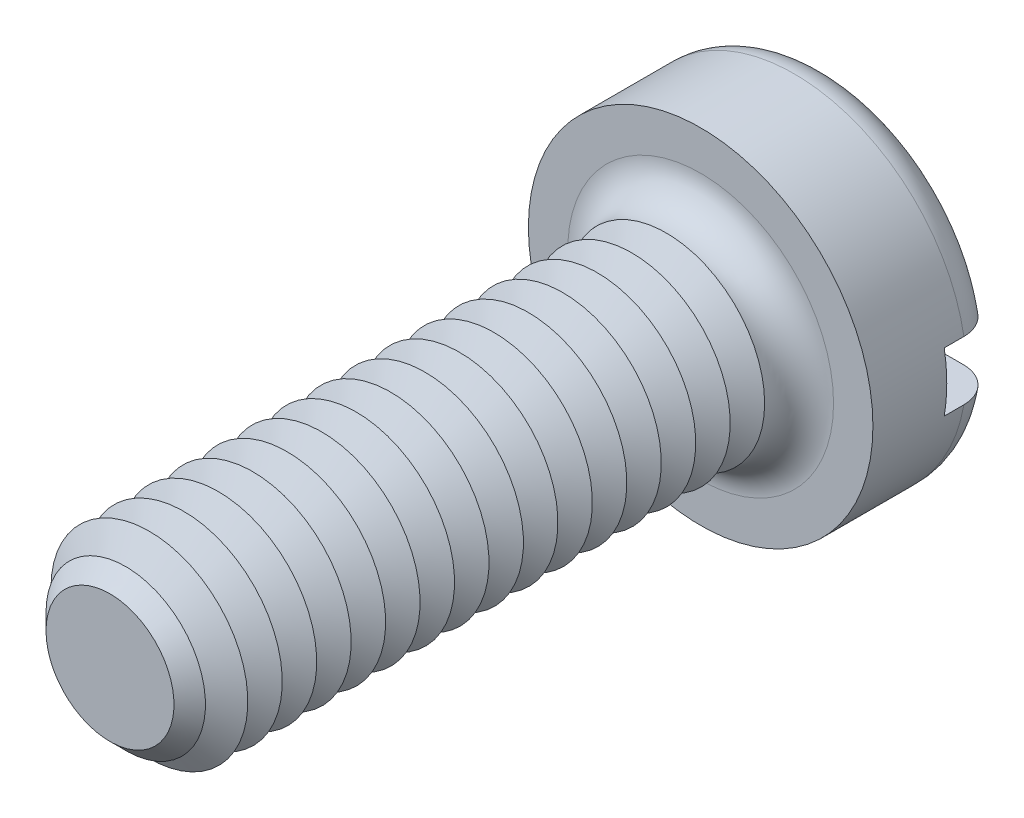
ISO-10303-21;
HEADER;
FILE_DESCRIPTION(('STEP AP214'),'2;1');
FILE_NAME('part.step','',(''),(''),'','','');
FILE_SCHEMA(('AUTOMOTIVE_DESIGN { 1 0 10303 214 1 1 1 1 }'));
ENDSEC;
DATA;
#1=APPLICATION_CONTEXT('core data for automotive mechanical design processes');
#2=APPLICATION_PROTOCOL_DEFINITION('international standard','automotive_design',2000,#1);
#3=PRODUCT_CONTEXT('',#1,'mechanical');
#4=PRODUCT('Part','Part','',(#3));
#5=PRODUCT_RELATED_PRODUCT_CATEGORY('part','',(#4));
#6=PRODUCT_DEFINITION_FORMATION('','',#4);
#7=PRODUCT_DEFINITION_CONTEXT('part definition',#1,'design');
#8=PRODUCT_DEFINITION('design','',#6,#7);
#9=PRODUCT_DEFINITION_SHAPE('','',#8);
#10=(LENGTH_UNIT() NAMED_UNIT(*) SI_UNIT(.MILLI.,.METRE.));
#11=(NAMED_UNIT(*) PLANE_ANGLE_UNIT() SI_UNIT($,.RADIAN.));
#12=(NAMED_UNIT(*) SI_UNIT($,.STERADIAN.) SOLID_ANGLE_UNIT());
#13=UNCERTAINTY_MEASURE_WITH_UNIT(LENGTH_MEASURE(1.E-05),#10,'distance_accuracy_value','');
#14=(GEOMETRIC_REPRESENTATION_CONTEXT(3) GLOBAL_UNCERTAINTY_ASSIGNED_CONTEXT((#13)) GLOBAL_UNIT_ASSIGNED_CONTEXT((#10,
#11,#12)) REPRESENTATION_CONTEXT('',''));
#15=CARTESIAN_POINT('',(0.,0.,0.));
#16=DIRECTION('',(0.,0.,1.));
#17=DIRECTION('',(1.,0.,0.));
#18=AXIS2_PLACEMENT_3D('',#15,#16,#17);
#19=CARTESIAN_POINT('',(0.,0.,-2.6));
#20=DIRECTION('',(0.,0.,1.));
#21=DIRECTION('',(1.,0.,0.));
#22=AXIS2_PLACEMENT_3D('',#19,#20,#21);
#23=PLANE('',#22);
#24=CARTESIAN_POINT('',(0.,0.,-2.6));
#25=DIRECTION('',(0.,0.,1.));
#26=DIRECTION('',(1.,0.,0.));
#27=AXIS2_PLACEMENT_3D('',#24,#25,#26);
#28=CIRCLE('',#27,2.8);
#29=CARTESIAN_POINT('',(-2.73495886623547,0.6,-2.6));
#30=VERTEX_POINT('',#29);
#31=CARTESIAN_POINT('',(2.73495886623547,0.6,-2.6));
#32=VERTEX_POINT('',#31);
#33=EDGE_CURVE('E116',#30,#32,#28,.F.);
#34=ORIENTED_EDGE('',*,*,#33,.T.);
#35=DIRECTION('',(1.,0.,0.));
#36=VECTOR('',#35,1.);
#37=CARTESIAN_POINT('',(-3.5,0.600000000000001,-2.6));
#38=LINE('',#37,#36);
#39=EDGE_CURVE('E111',#30,#32,#38,.T.);
#40=ORIENTED_EDGE('',*,*,#39,.F.);
#41=EDGE_LOOP('',(#34,#40));
#42=FACE_BOUND('',#41,.T.);
#43=ADVANCED_FACE('F39',(#42),#23,.F.);
#44=CARTESIAN_POINT('',(0.,0.,-1.9));
#45=DIRECTION('',(0.,0.,1.));
#46=DIRECTION('',(1.,0.,0.));
#47=AXIS2_PLACEMENT_3D('',#44,#45,#46);
#48=TOROIDAL_SURFACE('',#47,2.8,0.7);
#49=CARTESIAN_POINT('',(-3.24550494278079,0.600000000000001,-2.38938679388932));
#50=CARTESIAN_POINT('',(-3.21724139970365,0.600000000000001,-2.41780774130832));
#51=CARTESIAN_POINT('',(-3.18652103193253,0.600000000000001,-2.44383169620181));
#52=CARTESIAN_POINT('',(-3.12110229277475,0.600000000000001,-2.49034599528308));
#53=CARTESIAN_POINT('',(-3.08639834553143,0.6,-2.51082844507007));
#54=CARTESIAN_POINT('',(-3.01410013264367,0.6,-2.54568075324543));
#55=CARTESIAN_POINT('',(-2.97650963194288,0.6,-2.56005841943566));
#56=CARTESIAN_POINT('',(-2.89948250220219,0.6,-2.58239238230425));
#57=CARTESIAN_POINT('',(-2.86004633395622,0.6,-2.59035027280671));
#58=CARTESIAN_POINT('',(-2.77983715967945,0.6,-2.5997577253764));
#59=CARTESIAN_POINT('',(-2.73905311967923,0.6,-2.60111317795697));
#60=CARTESIAN_POINT('',(-2.65781876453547,0.6,-2.59706866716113));
#61=CARTESIAN_POINT('',(-2.61736849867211,0.6,-2.59166772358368));
#62=CARTESIAN_POINT('',(-2.53729983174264,0.6,-2.57414594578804));
#63=CARTESIAN_POINT('',(-2.49770360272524,0.6,-2.56192363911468));
#64=CARTESIAN_POINT('',(-2.421111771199,0.6,-2.5310238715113));
#65=CARTESIAN_POINT('',(-2.38411632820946,0.6,-2.51234601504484));
#66=CARTESIAN_POINT('',(-2.31371213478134,0.6,-2.46896762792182));
#67=CARTESIAN_POINT('',(-2.28031240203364,0.6,-2.44425244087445));
#68=CARTESIAN_POINT('',(-2.21823311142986,0.6,-2.38946667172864));
#69=CARTESIAN_POINT('',(-2.18955321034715,0.6,-2.35939647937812));
#70=CARTESIAN_POINT('',(-2.13836074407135,0.6,-2.29532787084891));
#71=CARTESIAN_POINT('',(-2.11574147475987,0.6,-2.26141482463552));
#72=CARTESIAN_POINT('',(-2.07677080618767,0.6,-2.19015935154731));
#73=CARTESIAN_POINT('',(-2.06041784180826,0.6,-2.15281778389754));
#74=CARTESIAN_POINT('',(-2.03508596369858,0.6,-2.07723332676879));
#75=CARTESIAN_POINT('',(-2.02585871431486,0.6,-2.03907365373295));
#76=CARTESIAN_POINT('',(-2.01416722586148,0.6,-1.96173417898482));
#77=CARTESIAN_POINT('',(-2.01170151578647,0.6,-1.92255460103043));
#78=CARTESIAN_POINT('',(-2.01359934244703,0.6,-1.84555709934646));
#79=CARTESIAN_POINT('',(-2.01775787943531,0.6,-1.80773393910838));
#80=CARTESIAN_POINT('',(-2.03236373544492,0.6,-1.73332511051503));
#81=CARTESIAN_POINT('',(-2.04281097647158,0.6,-1.69673942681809));
#82=CARTESIAN_POINT('',(-2.06962963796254,0.6,-1.62577336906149));
#83=CARTESIAN_POINT('',(-2.08600685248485,0.6,-1.59139519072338));
#84=CARTESIAN_POINT('',(-2.12413495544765,0.6,-1.52576356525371));
#85=CARTESIAN_POINT('',(-2.14588657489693,0.6,-1.49451054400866));
#86=CARTESIAN_POINT('',(-2.19483541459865,0.6,-1.43498643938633));
#87=CARTESIAN_POINT('',(-2.22217844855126,0.6,-1.40683532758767));
#88=CARTESIAN_POINT('',(-2.28105616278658,0.6,-1.35532544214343));
#89=CARTESIAN_POINT('',(-2.3125916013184,0.6,-1.33196753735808));
#90=CARTESIAN_POINT('',(-2.38018779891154,0.6,-1.28984356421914));
#91=CARTESIAN_POINT('',(-2.41637068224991,0.6,-1.27127330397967));
#92=CARTESIAN_POINT('',(-2.49129688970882,0.6,-1.24032971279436));
#93=CARTESIAN_POINT('',(-2.53004053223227,0.6,-1.22795715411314));
#94=CARTESIAN_POINT('',(-2.6098393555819,0.6,-1.2095515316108));
#95=CARTESIAN_POINT('',(-2.65092550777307,0.6,-1.20365237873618));
#96=CARTESIAN_POINT('',(-2.7335069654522,0.6,-1.1988380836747));
#97=CARTESIAN_POINT('',(-2.7750022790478,0.6,-1.19992308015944));
#98=CARTESIAN_POINT('',(-2.85718851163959,0.6,-1.20909046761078));
#99=CARTESIAN_POINT('',(-2.8978799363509,0.6,-1.21716830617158));
#100=CARTESIAN_POINT('',(-2.97729176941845,0.6,-1.24014327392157));
#101=CARTESIAN_POINT('',(-3.01601231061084,0.6,-1.25503994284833));
#102=CARTESIAN_POINT('',(-3.08976822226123,0.6,-1.29101066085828));
#103=CARTESIAN_POINT('',(-3.12484927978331,0.600000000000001,-1.31199098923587));
#104=CARTESIAN_POINT('',(-3.19090022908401,0.600000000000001,-1.35965144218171));
#105=CARTESIAN_POINT('',(-3.22187053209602,0.600000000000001,-1.38633099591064));
#106=CARTESIAN_POINT('',(-3.2781946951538,0.600000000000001,-1.44408564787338));
#107=CARTESIAN_POINT('',(-3.3036441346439,0.600000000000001,-1.47506754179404));
#108=CARTESIAN_POINT('',(-3.34887649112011,0.600000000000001,-1.54092398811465));
#109=CARTESIAN_POINT('',(-3.36865993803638,0.600000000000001,-1.57579817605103));
#110=CARTESIAN_POINT('',(-3.40166738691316,0.600000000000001,-1.64783067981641));
#111=CARTESIAN_POINT('',(-3.41499360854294,0.600000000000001,-1.68494217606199));
#112=CARTESIAN_POINT('',(-3.43515375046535,0.600000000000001,-1.76088675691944));
#113=CARTESIAN_POINT('',(-3.44198836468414,0.600000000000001,-1.79971965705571));
#114=CARTESIAN_POINT('',(-3.44891916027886,0.600000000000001,-1.87757893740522));
#115=CARTESIAN_POINT('',(-3.44908375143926,0.600000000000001,-1.91659924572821));
#116=CARTESIAN_POINT('',(-3.44284111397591,0.600000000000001,-1.99412088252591));
#117=CARTESIAN_POINT('',(-3.43643236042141,0.600000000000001,-2.03262208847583));
#118=CARTESIAN_POINT('',(-3.41725803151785,0.600000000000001,-2.10792315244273));
#119=CARTESIAN_POINT('',(-3.40450469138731,0.600000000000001,-2.14472613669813));
#120=CARTESIAN_POINT('',(-3.3730385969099,0.600000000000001,-2.21565060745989));
#121=CARTESIAN_POINT('',(-3.35433321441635,0.600000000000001,-2.24977534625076));
#122=CARTESIAN_POINT('',(-3.3201892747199,0.600000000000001,-2.30136364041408));
#123=CARTESIAN_POINT('',(-3.30647805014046,0.600000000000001,-2.31999402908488));
#124=CARTESIAN_POINT('',(-3.27728518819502,0.600000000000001,-2.35581090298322));
#125=CARTESIAN_POINT('',(-3.26180356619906,0.600000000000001,-2.37299740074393));
#126=CARTESIAN_POINT('',(-3.24550494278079,0.600000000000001,-2.38938679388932));
#127=B_SPLINE_CURVE_WITH_KNOTS('',3,(#49,#50,#51,#52,#53,#54,#55,#56,#57,#58,#59,#60,#61,#62,
#63,#64,#65,#66,#67,#68,#69,#70,#71,#72,#73,#74,#75,#76,#77,#78,#79,#80,#81,#82,#83,#84,#85,#86,
#87,#88,#89,#90,#91,#92,#93,#94,#95,#96,#97,#98,#99,#100,#101,#102,#103,#104,#105,#106,#107,
#108,#109,#110,#111,#112,#113,#114,#115,#116,#117,#118,#119,#120,#121,#122,#123,#124,#125,#126),
.UNSPECIFIED.,.T.,.F.,(4,2,2,2,2,2,2,2,2,2,2,2,2,2,2,2,2,2,2,2,2,2,2,2,2,2,2,2,2,2,2,2,2,2,2,2,
2,2,4),(0.,0.120160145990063,0.240490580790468,0.36066665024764,0.480812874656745,
0.602666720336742,0.724538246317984,0.848272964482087,0.972015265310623,1.09606100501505,
1.2200977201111,1.34178071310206,1.46343329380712,1.58062647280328,1.6977941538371,
1.81140573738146,1.92501591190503,2.03873739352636,2.15247435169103,2.26967910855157,
2.38690509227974,2.50835551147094,2.62982106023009,2.75375450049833,2.87769040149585,
3.00154567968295,3.12539259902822,3.24742469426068,3.36944457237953,3.48914477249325,
3.60883377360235,3.72656056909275,3.84427477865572,3.96078136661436,4.07731498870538,
4.19362474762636,4.3097910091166,4.37908387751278,4.44837614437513),.UNSPECIFIED.);
#128=CARTESIAN_POINT('',(-3.44818792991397,0.600000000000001,-1.8999999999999));
#129=VERTEX_POINT('',#128);
#130=EDGE_CURVE('E312',#129,#30,#127,.T.);
#131=ORIENTED_EDGE('',*,*,#130,.F.);
#132=CARTESIAN_POINT('',(0.,0.,-1.9));
#133=DIRECTION('',(0.,0.,1.));
#134=DIRECTION('',(1.,0.,0.));
#135=AXIS2_PLACEMENT_3D('',#132,#133,#134);
#136=CIRCLE('',#135,3.5);
#137=CARTESIAN_POINT('',(3.44818792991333,0.6,-1.9));
#138=VERTEX_POINT('',#137);
#139=EDGE_CURVE('E124',#138,#129,#136,.T.);
#140=ORIENTED_EDGE('',*,*,#139,.F.);
#141=CARTESIAN_POINT('',(2.1414268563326,0.6,-2.29762171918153));
#142=CARTESIAN_POINT('',(2.16505443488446,0.6,-2.33058245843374));
#143=CARTESIAN_POINT('',(2.19155609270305,0.6,-2.36152717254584));
#144=CARTESIAN_POINT('',(2.24942944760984,0.6,-2.41852964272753));
#145=CARTESIAN_POINT('',(2.28080921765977,0.6,-2.44457913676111));
#146=CARTESIAN_POINT('',(2.34741203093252,0.6,-2.49105381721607));
#147=CARTESIAN_POINT('',(2.38262862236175,0.6,-2.51148824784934));
#148=CARTESIAN_POINT('',(2.45593176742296,0.6,-2.54626881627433));
#149=CARTESIAN_POINT('',(2.49401741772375,0.6,-2.56061686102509));
#150=CARTESIAN_POINT('',(2.57272605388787,0.6,-2.58306429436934));
#151=CARTESIAN_POINT('',(2.6133821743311,0.6,-2.59104769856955));
#152=CARTESIAN_POINT('',(2.6954618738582,0.6,-2.60009608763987));
#153=CARTESIAN_POINT('',(2.73688552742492,0.6,-2.60116039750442));
#154=CARTESIAN_POINT('',(2.81941950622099,0.6,-2.5962925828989));
#155=CARTESIAN_POINT('',(2.86052888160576,0.6,-2.59034422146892));
#156=CARTESIAN_POINT('',(2.94113709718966,0.6,-2.57153687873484));
#157=CARTESIAN_POINT('',(2.98063603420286,0.6,-2.55867831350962));
#158=CARTESIAN_POINT('',(3.05633735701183,0.6,-2.52657771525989));
#159=CARTESIAN_POINT('',(3.09257627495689,0.6,-2.50742188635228));
#160=CARTESIAN_POINT('',(3.16123898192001,0.6,-2.46318606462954));
#161=CARTESIAN_POINT('',(3.19366316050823,0.6,-2.4381066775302));
#162=CARTESIAN_POINT('',(3.25312278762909,0.6,-2.38324481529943));
#163=CARTESIAN_POINT('',(3.28024842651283,0.6,-2.35356008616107));
#164=CARTESIAN_POINT('',(3.32902587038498,0.6,-2.28998971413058));
#165=CARTESIAN_POINT('',(3.35067820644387,0.6,-2.25610447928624));
#166=CARTESIAN_POINT('',(3.38751207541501,0.6,-2.18572286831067));
#167=CARTESIAN_POINT('',(3.40279804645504,0.6,-2.14928112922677));
#168=CARTESIAN_POINT('',(3.42695590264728,0.6,-2.07433042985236));
#169=CARTESIAN_POINT('',(3.43582824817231,0.6,-2.03582161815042));
#170=CARTESIAN_POINT('',(3.44682113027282,0.6,-1.95829536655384));
#171=CARTESIAN_POINT('',(3.44901648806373,0.6,-1.91928851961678));
#172=CARTESIAN_POINT('',(3.44680085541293,0.6,-1.84146366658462));
#173=CARTESIAN_POINT('',(3.44239008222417,0.6,-1.80264565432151));
#174=CARTESIAN_POINT('',(3.42712544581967,0.6,-1.72644634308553));
#175=CARTESIAN_POINT('',(3.41629508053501,0.6,-1.6890603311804));
#176=CARTESIAN_POINT('',(3.38853757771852,0.6,-1.61662604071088));
#177=CARTESIAN_POINT('',(3.37161039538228,0.6,-1.58157777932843));
#178=CARTESIAN_POINT('',(3.33207798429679,0.6,-1.51464178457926));
#179=CARTESIAN_POINT('',(3.30944854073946,0.6,-1.48276835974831));
#180=CARTESIAN_POINT('',(3.2592165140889,0.6,-1.42321861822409));
#181=CARTESIAN_POINT('',(3.23161370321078,0.6,-1.3955424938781));
#182=CARTESIAN_POINT('',(3.17188519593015,0.6,-1.34481834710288));
#183=CARTESIAN_POINT('',(3.13971065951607,0.6,-1.32182785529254));
#184=CARTESIAN_POINT('',(3.07201123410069,0.6,-1.28147003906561));
#185=CARTESIAN_POINT('',(3.03648608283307,0.6,-1.26410315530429));
#186=CARTESIAN_POINT('',(2.962449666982,0.6,-1.2351645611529));
#187=CARTESIAN_POINT('',(2.92389781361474,0.6,-1.22369671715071));
#188=CARTESIAN_POINT('',(2.84543273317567,0.6,-1.20726565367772));
#189=CARTESIAN_POINT('',(2.80551936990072,0.6,-1.20230308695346));
#190=CARTESIAN_POINT('',(2.72467191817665,0.6,-1.1989357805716));
#191=CARTESIAN_POINT('',(2.68373266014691,0.6,-1.20065484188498));
#192=CARTESIAN_POINT('',(2.60270222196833,0.6,-1.21084560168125));
#193=CARTESIAN_POINT('',(2.56261112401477,0.6,-1.21931795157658));
#194=CARTESIAN_POINT('',(2.48385954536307,0.6,-1.24292934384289));
#195=CARTESIAN_POINT('',(2.44522508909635,0.6,-1.25815531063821));
#196=CARTESIAN_POINT('',(2.37106165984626,0.6,-1.29488663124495));
#197=CARTESIAN_POINT('',(2.33553282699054,0.6,-1.31639226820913));
#198=CARTESIAN_POINT('',(2.2686996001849,0.6,-1.36507949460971));
#199=CARTESIAN_POINT('',(2.23738745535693,0.6,-1.39225042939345));
#200=CARTESIAN_POINT('',(2.17990424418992,0.6,-1.45157941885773));
#201=CARTESIAN_POINT('',(2.15373259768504,0.6,-1.48373691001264));
#202=CARTESIAN_POINT('',(2.10799355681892,0.6,-1.551327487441));
#203=CARTESIAN_POINT('',(2.08828258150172,0.6,-1.58666329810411));
#204=CARTESIAN_POINT('',(2.05534440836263,0.6,-1.66023600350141));
#205=CARTESIAN_POINT('',(2.042115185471,0.6,-1.6984719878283));
#206=CARTESIAN_POINT('',(2.02303126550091,0.6,-1.77519783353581));
#207=CARTESIAN_POINT('',(2.01691541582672,0.6,-1.8136228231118));
#208=CARTESIAN_POINT('',(2.01140375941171,0.6,-1.89096056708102));
#209=CARTESIAN_POINT('',(2.01200856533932,0.6,-1.92987336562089));
#210=CARTESIAN_POINT('',(2.01981617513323,0.6,-2.006065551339));
#211=CARTESIAN_POINT('',(2.02685835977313,0.6,-2.04336165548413));
#212=CARTESIAN_POINT('',(2.0470502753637,0.6,-2.1162250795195));
#213=CARTESIAN_POINT('',(2.06019252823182,0.6,-2.15179445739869));
#214=CARTESIAN_POINT('',(2.08525738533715,0.6,-2.20558874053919));
#215=CARTESIAN_POINT('',(2.09529161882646,0.6,-2.22471751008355));
#216=CARTESIAN_POINT('',(2.11708813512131,0.6,-2.26196179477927));
#217=CARTESIAN_POINT('',(2.12885034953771,0.6,-2.28007734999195));
#218=CARTESIAN_POINT('',(2.1414268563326,0.6,-2.29762171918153));
#219=B_SPLINE_CURVE_WITH_KNOTS('',3,(#141,#142,#143,#144,#145,#146,#147,#148,#149,#150,#151,
#152,#153,#154,#155,#156,#157,#158,#159,#160,#161,#162,#163,#164,#165,#166,#167,#168,#169,#170,
#171,#172,#173,#174,#175,#176,#177,#178,#179,#180,#181,#182,#183,#184,#185,#186,#187,#188,#189,
#190,#191,#192,#193,#194,#195,#196,#197,#198,#199,#200,#201,#202,#203,#204,#205,#206,#207,#208,
#209,#210,#211,#212,#213,#214,#215,#216,#217,#218),.UNSPECIFIED.,.T.,.F.,(4,2,2,2,2,2,2,2,2,2,2,
2,2,2,2,2,2,2,2,2,2,2,2,2,2,2,2,2,2,2,2,2,2,2,2,2,2,2,4),(0.,0.121582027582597,
0.243367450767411,0.364951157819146,0.486496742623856,0.610209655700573,0.733934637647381,
0.857946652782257,0.981951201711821,1.1043243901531,1.22668507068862,1.34673532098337,
1.46677391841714,1.58475736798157,1.70273234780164,1.81938035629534,1.93602452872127,
2.05224435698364,2.168465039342,2.28518782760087,2.40191596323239,2.52000081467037,
2.63809491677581,2.75820270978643,2.87832255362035,3.00067856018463,3.1230463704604,
3.24703703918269,3.37103329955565,3.49479843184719,3.6185495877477,3.73932715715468,
3.86006696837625,3.9762182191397,4.09238005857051,4.2057203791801,4.31892212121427,
4.38364046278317,4.44835624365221),.UNSPECIFIED.);
#220=EDGE_CURVE('E314',#32,#138,#219,.T.);
#221=ORIENTED_EDGE('',*,*,#220,.F.);
#222=ORIENTED_EDGE('',*,*,#33,.F.);
#223=EDGE_LOOP('',(#131,#140,#221,#222));
#224=FACE_BOUND('',#223,.T.);
#225=ADVANCED_FACE('F296',(#224),#48,.T.);
#226=CARTESIAN_POINT('',(0.,0.,-2.6));
#227=DIRECTION('',(0.,0.,1.));
#228=DIRECTION('',(1.,0.,0.));
#229=AXIS2_PLACEMENT_3D('',#226,#227,#228);
#230=CYLINDRICAL_SURFACE('',#229,3.5);
#231=DIRECTION('',(0.,0.,1.));
#232=VECTOR('',#231,1.);
#233=CARTESIAN_POINT('',(3.44818792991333,0.6,-2.6));
#234=LINE('',#233,#232);
#235=CARTESIAN_POINT('',(3.44818792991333,0.6,-1.5));
#236=VERTEX_POINT('',#235);
#237=EDGE_CURVE('E329',#138,#236,#234,.T.);
#238=ORIENTED_EDGE('',*,*,#237,.F.);
#239=ORIENTED_EDGE('',*,*,#139,.T.);
#240=DIRECTION('',(0.,0.,1.));
#241=VECTOR('',#240,1.);
#242=CARTESIAN_POINT('',(-3.44818792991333,0.600000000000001,-2.6));
#243=LINE('',#242,#241);
#244=CARTESIAN_POINT('',(-3.44818792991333,0.600000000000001,-1.5));
#245=VERTEX_POINT('',#244);
#246=EDGE_CURVE('E63',#245,#129,#243,.F.);
#247=ORIENTED_EDGE('',*,*,#246,.F.);
#248=CARTESIAN_POINT('',(0.,0.,-1.5));
#249=DIRECTION('',(0.,0.,-1.));
#250=DIRECTION('',(-1.,0.,0.));
#251=AXIS2_PLACEMENT_3D('',#248,#249,#250);
#252=CIRCLE('',#251,3.5);
#253=CARTESIAN_POINT('',(-3.44818792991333,-0.599999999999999,-1.5));
#254=VERTEX_POINT('',#253);
#255=EDGE_CURVE('E43',#245,#254,#252,.F.);
#256=ORIENTED_EDGE('',*,*,#255,.T.);
#257=DIRECTION('',(0.,0.,1.));
#258=VECTOR('',#257,1.);
#259=CARTESIAN_POINT('',(-3.44818792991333,-0.599999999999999,-2.6));
#260=LINE('',#259,#258);
#261=CARTESIAN_POINT('',(-3.44818792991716,-0.599999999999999,-1.90000000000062));
#262=VERTEX_POINT('',#261);
#263=EDGE_CURVE('E327',#262,#254,#260,.T.);
#264=ORIENTED_EDGE('',*,*,#263,.F.);
#265=CARTESIAN_POINT('',(3.44818792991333,-0.6,-1.9));
#266=VERTEX_POINT('',#265);
#267=EDGE_CURVE('E126',#262,#266,#136,.T.);
#268=ORIENTED_EDGE('',*,*,#267,.T.);
#269=DIRECTION('',(0.,0.,1.));
#270=VECTOR('',#269,1.);
#271=CARTESIAN_POINT('',(3.44818792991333,-0.6,-2.6));
#272=LINE('',#271,#270);
#273=CARTESIAN_POINT('',(3.44818792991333,-0.6,-1.5));
#274=VERTEX_POINT('',#273);
#275=EDGE_CURVE('E55',#274,#266,#272,.F.);
#276=ORIENTED_EDGE('',*,*,#275,.F.);
#277=EDGE_CURVE('E11',#274,#236,#252,.F.);
#278=ORIENTED_EDGE('',*,*,#277,.T.);
#279=EDGE_LOOP('',(#238,#239,#247,#256,#264,#268,#276,#278));
#280=FACE_BOUND('',#279,.T.);
#281=CARTESIAN_POINT('',(0.,0.,0.));
#282=DIRECTION('',(0.,0.,1.));
#283=DIRECTION('',(1.,0.,0.));
#284=AXIS2_PLACEMENT_3D('',#281,#282,#283);
#285=CIRCLE('',#284,3.5);
#286=CARTESIAN_POINT('',(3.5,0.,0.));
#287=VERTEX_POINT('',#286);
#288=EDGE_CURVE('E331',#287,#287,#285,.T.);
#289=ORIENTED_EDGE('',*,*,#288,.F.);
#290=EDGE_LOOP('',(#289));
#291=FACE_BOUND('',#290,.T.);
#292=ADVANCED_FACE('F292',(#280,#291),#230,.T.);
#293=CARTESIAN_POINT('',(2.73495886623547,-0.6,-2.6));
#294=VERTEX_POINT('',#293);
#295=CARTESIAN_POINT('',(-2.73495886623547,-0.6,-2.6));
#296=VERTEX_POINT('',#295);
#297=EDGE_CURVE('E109',#294,#296,#28,.F.);
#298=ORIENTED_EDGE('',*,*,#297,.T.);
#299=DIRECTION('',(-1.,0.,0.));
#300=VECTOR('',#299,1.);
#301=CARTESIAN_POINT('',(-3.5,-0.599999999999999,-2.6));
#302=LINE('',#301,#300);
#303=EDGE_CURVE('E96',#294,#296,#302,.T.);
#304=ORIENTED_EDGE('',*,*,#303,.F.);
#305=EDGE_LOOP('',(#298,#304));
#306=FACE_BOUND('',#305,.T.);
#307=ADVANCED_FACE('F108',(#306),#23,.F.);
#308=CARTESIAN_POINT('',(0.,0.,0.));
#309=DIRECTION('',(0.,0.,1.));
#310=DIRECTION('',(1.,0.,0.));
#311=AXIS2_PLACEMENT_3D('',#308,#309,#310);
#312=PLANE('',#311);
#313=CARTESIAN_POINT('',(0.,0.,0.));
#314=DIRECTION('',(0.,0.,1.));
#315=DIRECTION('',(1.,0.,0.));
#316=AXIS2_PLACEMENT_3D('',#313,#314,#315);
#317=CIRCLE('',#316,2.7);
#318=CARTESIAN_POINT('',(2.7,0.,0.));
#319=VERTEX_POINT('',#318);
#320=EDGE_CURVE('E115',#319,#319,#317,.F.);
#321=ORIENTED_EDGE('',*,*,#320,.T.);
#322=EDGE_LOOP('',(#321));
#323=FACE_BOUND('',#322,.T.);
#324=ORIENTED_EDGE('',*,*,#288,.T.);
#325=EDGE_LOOP('',(#324));
#326=FACE_BOUND('',#325,.T.);
#327=ADVANCED_FACE('F291',(#323,#326),#312,.T.);
#328=CARTESIAN_POINT('',(-3.24550494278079,-0.599999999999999,-2.38938679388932));
#329=CARTESIAN_POINT('',(-3.27309693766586,-0.599999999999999,-2.36163611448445));
#330=CARTESIAN_POINT('',(-3.29838741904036,-0.599999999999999,-2.3315608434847));
#331=CARTESIAN_POINT('',(-3.34359429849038,-0.599999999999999,-2.26757659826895));
#332=CARTESIAN_POINT('',(-3.36350518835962,-0.599999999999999,-2.23366374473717));
#333=CARTESIAN_POINT('',(-3.39733065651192,-0.599999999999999,-2.16296274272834));
#334=CARTESIAN_POINT('',(-3.4112451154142,-0.599999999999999,-2.12617453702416));
#335=CARTESIAN_POINT('',(-3.43264462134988,-0.599999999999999,-2.05078178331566));
#336=CARTESIAN_POINT('',(-3.44013114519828,-0.599999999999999,-2.01217765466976));
#337=CARTESIAN_POINT('',(-3.44841975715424,-0.599999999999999,-1.9345391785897));
#338=CARTESIAN_POINT('',(-3.44926944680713,-0.599999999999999,-1.89550990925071));
#339=CARTESIAN_POINT('',(-3.44438358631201,-0.599999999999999,-1.81786552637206));
#340=CARTESIAN_POINT('',(-3.43864801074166,-0.599999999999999,-1.77925041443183));
#341=CARTESIAN_POINT('',(-3.42079221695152,-0.599999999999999,-1.70364264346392));
#342=CARTESIAN_POINT('',(-3.40869011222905,-0.599999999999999,-1.66664570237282));
#343=CARTESIAN_POINT('',(-3.37847692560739,-0.599999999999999,-1.59519424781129));
#344=CARTESIAN_POINT('',(-3.3603657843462,-0.599999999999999,-1.56073975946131));
#345=CARTESIAN_POINT('',(-3.31856549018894,-0.599999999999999,-1.4951524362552));
#346=CARTESIAN_POINT('',(-3.29484830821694,-0.599999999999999,-1.46403747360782));
#347=CARTESIAN_POINT('',(-3.24258489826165,-0.599999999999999,-1.40617131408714));
#348=CARTESIAN_POINT('',(-3.21403843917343,-0.599999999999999,-1.37942032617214));
#349=CARTESIAN_POINT('',(-3.15256084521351,-0.599999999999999,-1.33067963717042));
#350=CARTESIAN_POINT('',(-3.11958015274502,-0.599999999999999,-1.30875246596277));
#351=CARTESIAN_POINT('',(-3.0504559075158,-0.599999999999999,-1.27063718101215));
#352=CARTESIAN_POINT('',(-3.01431209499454,-0.6,-1.25444953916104));
#353=CARTESIAN_POINT('',(-2.93921710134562,-0.6,-1.22796796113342));
#354=CARTESIAN_POINT('',(-2.90022796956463,-0.6,-1.217781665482));
#355=CARTESIAN_POINT('',(-2.82110512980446,-0.6,-1.20396915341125));
#356=CARTESIAN_POINT('',(-2.7809713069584,-0.6,-1.2003435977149));
#357=CARTESIAN_POINT('',(-2.69990924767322,-0.6,-1.19969717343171));
#358=CARTESIAN_POINT('',(-2.65898001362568,-0.6,-1.20279937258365));
#359=CARTESIAN_POINT('',(-2.57819986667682,-0.6,-1.21574287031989));
#360=CARTESIAN_POINT('',(-2.53834905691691,-0.6,-1.22558481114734));
#361=CARTESIAN_POINT('',(-2.46035232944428,-0.6,-1.25189361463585));
#362=CARTESIAN_POINT('',(-2.42223314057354,-0.6,-1.2684398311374));
#363=CARTESIAN_POINT('',(-2.34932316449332,-0.6,-1.30771928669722));
#364=CARTESIAN_POINT('',(-2.31453248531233,-0.6,-1.33045272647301));
#365=CARTESIAN_POINT('',(-2.24945577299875,-0.6,-1.38141543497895));
#366=CARTESIAN_POINT('',(-2.21915255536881,-0.6,-1.40962272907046));
#367=CARTESIAN_POINT('',(-2.16386461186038,-0.6,-1.47084552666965));
#368=CARTESIAN_POINT('',(-2.13887916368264,-0.6,-1.50386037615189));
#369=CARTESIAN_POINT('',(-2.09568071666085,-0.6,-1.57285917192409));
#370=CARTESIAN_POINT('',(-2.07730739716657,-0.6,-1.60874263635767));
#371=CARTESIAN_POINT('',(-2.04712019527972,-0.6,-1.68316975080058));
#372=CARTESIAN_POINT('',(-2.03530452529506,-0.6,-1.72171267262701));
#373=CARTESIAN_POINT('',(-2.01901751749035,-0.6,-1.79878952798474));
#374=CARTESIAN_POINT('',(-2.01428434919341,-0.6,-1.8372682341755));
#375=CARTESIAN_POINT('',(-2.01150652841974,-0.6,-1.91446369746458));
#376=CARTESIAN_POINT('',(-2.01346084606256,-0.6,-1.95318041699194));
#377=CARTESIAN_POINT('',(-2.02386268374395,-0.6,-2.0288619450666));
#378=CARTESIAN_POINT('',(-2.03216724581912,-0.6,-2.06584654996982));
#379=CARTESIAN_POINT('',(-2.05479337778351,-0.6,-2.13792373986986));
#380=CARTESIAN_POINT('',(-2.06911522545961,-0.6,-2.1730162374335));
#381=CARTESIAN_POINT('',(-2.10349906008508,-0.6,-2.24081034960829));
#382=CARTESIAN_POINT('',(-2.12363007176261,-0.6,-2.27347689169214));
#383=CARTESIAN_POINT('',(-2.16891308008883,-0.6,-2.33511902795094));
#384=CARTESIAN_POINT('',(-2.19406590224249,-0.6,-2.36409401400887));
#385=CARTESIAN_POINT('',(-2.24962389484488,-0.6,-2.41861972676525));
#386=CARTESIAN_POINT('',(-2.28018314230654,-0.6,-2.44401345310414));
#387=CARTESIAN_POINT('',(-2.34501720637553,-0.6,-2.48950558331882));
#388=CARTESIAN_POINT('',(-2.37929266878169,-0.6,-2.50960306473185));
#389=CARTESIAN_POINT('',(-2.45179417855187,-0.6,-2.54458276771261));
#390=CARTESIAN_POINT('',(-2.49011248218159,-0.6,-2.55927401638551));
#391=CARTESIAN_POINT('',(-2.56865227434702,-0.6,-2.58211133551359));
#392=CARTESIAN_POINT('',(-2.60887386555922,-0.6,-2.59025705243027));
#393=CARTESIAN_POINT('',(-2.69064746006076,-0.6,-2.59982905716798));
#394=CARTESIAN_POINT('',(-2.73220999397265,-0.6,-2.60116580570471));
#395=CARTESIAN_POINT('',(-2.81497658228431,-0.6,-2.59679700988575));
#396=CARTESIAN_POINT('',(-2.85618055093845,-0.6,-2.59108982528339));
#397=CARTESIAN_POINT('',(-2.93677683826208,-0.6,-2.57279487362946));
#398=CARTESIAN_POINT('',(-2.97617834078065,-0.6,-2.56024753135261));
#399=CARTESIAN_POINT('',(-3.05222242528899,-0.6,-2.52860709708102));
#400=CARTESIAN_POINT('',(-3.08886850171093,-0.599999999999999,-2.50952247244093));
#401=CARTESIAN_POINT('',(-3.14562501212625,-0.599999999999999,-2.47340693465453));
#402=CARTESIAN_POINT('',(-3.16689358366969,-0.599999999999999,-2.45816337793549));
#403=CARTESIAN_POINT('',(-3.20761866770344,-0.599999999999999,-2.42542115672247));
#404=CARTESIAN_POINT('',(-3.22707520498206,-0.599999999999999,-2.40792252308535));
#405=CARTESIAN_POINT('',(-3.24550494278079,-0.599999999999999,-2.38938679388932));
#406=B_SPLINE_CURVE_WITH_KNOTS('',3,(#328,#329,#330,#331,#332,#333,#334,#335,#336,#337,#338,
#339,#340,#341,#342,#343,#344,#345,#346,#347,#348,#349,#350,#351,#352,#353,#354,#355,#356,#357,
#358,#359,#360,#361,#362,#363,#364,#365,#366,#367,#368,#369,#370,#371,#372,#373,#374,#375,#376,
#377,#378,#379,#380,#381,#382,#383,#384,#385,#386,#387,#388,#389,#390,#391,#392,#393,#394,#395,
#396,#397,#398,#399,#400,#401,#402,#403,#404,#405),.UNSPECIFIED.,.T.,.F.,(4,2,2,2,2,2,2,2,2,2,2,
2,2,2,2,2,2,2,2,2,2,2,2,2,2,2,2,2,2,2,2,2,2,2,2,2,2,2,4),(0.,0.117306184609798,
0.234732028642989,0.352160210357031,0.469561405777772,0.586119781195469,0.702678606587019,
0.818907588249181,0.935137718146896,1.05196174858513,1.1687913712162,1.2870562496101,
1.40533084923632,1.52566688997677,1.64601504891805,1.76858322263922,1.89116307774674,
2.01523830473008,2.13931755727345,2.26290863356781,2.38648291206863,2.50681878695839,
2.62712184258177,2.74285697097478,2.85857427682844,2.97176054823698,3.08495204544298,
3.19954814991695,3.31416310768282,3.43282436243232,3.55150627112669,3.67404987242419,
3.79660009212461,3.92075778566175,4.04494439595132,4.16840490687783,4.29170610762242,
4.3700604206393,4.44841366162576),.UNSPECIFIED.);
#407=EDGE_CURVE('E103',#296,#262,#406,.T.);
#408=ORIENTED_EDGE('',*,*,#407,.F.);
#409=ORIENTED_EDGE('',*,*,#297,.F.);
#410=CARTESIAN_POINT('',(2.1414268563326,-0.6,-2.29762171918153));
#411=CARTESIAN_POINT('',(2.11900044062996,-0.6,-2.26633119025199));
#412=CARTESIAN_POINT('',(2.09913154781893,-0.6,-2.23318080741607));
#413=CARTESIAN_POINT('',(2.06517900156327,-0.6,-2.16401111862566));
#414=CARTESIAN_POINT('',(2.05109968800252,-0.6,-2.12798968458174));
#415=CARTESIAN_POINT('',(2.02923593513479,-0.6,-2.05404277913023));
#416=CARTESIAN_POINT('',(2.02145692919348,-0.6,-2.01611569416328));
#417=CARTESIAN_POINT('',(2.01251710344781,-0.6,-1.93949649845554));
#418=CARTESIAN_POINT('',(2.01135461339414,-0.6,-1.90080458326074));
#419=CARTESIAN_POINT('',(2.01564803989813,-0.6,-1.82450508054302));
#420=CARTESIAN_POINT('',(2.02098305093,-0.6,-1.78689061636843));
#421=CARTESIAN_POINT('',(2.03786826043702,-0.6,-1.71308589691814));
#422=CARTESIAN_POINT('',(2.04941870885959,-0.6,-1.67689569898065));
#423=CARTESIAN_POINT('',(2.07838664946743,-0.6,-1.60676639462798));
#424=CARTESIAN_POINT('',(2.09582944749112,-0.6,-1.57283776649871));
#425=CARTESIAN_POINT('',(2.1359925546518,-0.6,-1.50826612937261));
#426=CARTESIAN_POINT('',(2.15871360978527,-0.6,-1.47762358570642));
#427=CARTESIAN_POINT('',(2.20955413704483,-0.6,-1.41943384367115));
#428=CARTESIAN_POINT('',(2.23782364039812,-0.6,-1.39201777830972));
#429=CARTESIAN_POINT('',(2.29842612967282,-0.6,-1.34212199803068));
#430=CARTESIAN_POINT('',(2.33075984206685,-0.6,-1.31964316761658));
#431=CARTESIAN_POINT('',(2.399806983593,-0.6,-1.27945238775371));
#432=CARTESIAN_POINT('',(2.43663466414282,-0.6,-1.26193653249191));
#433=CARTESIAN_POINT('',(2.51267241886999,-0.6,-1.23320660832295));
#434=CARTESIAN_POINT('',(2.55188277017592,-0.6,-1.22199327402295));
#435=CARTESIAN_POINT('',(2.63235000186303,-0.6,-1.20602688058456));
#436=CARTESIAN_POINT('',(2.673631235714,-0.6,-1.20139617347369));
#437=CARTESIAN_POINT('',(2.7563863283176,-0.6,-1.19914622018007));
#438=CARTESIAN_POINT('',(2.79786018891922,-0.6,-1.20152704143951));
#439=CARTESIAN_POINT('',(2.87971192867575,-0.6,-1.21326884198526));
#440=CARTESIAN_POINT('',(2.92009214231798,-0.6,-1.22261349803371));
#441=CARTESIAN_POINT('',(2.99866777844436,-0.6,-1.24805614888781));
#442=CARTESIAN_POINT('',(3.03686335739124,-0.6,-1.26415365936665));
#443=CARTESIAN_POINT('',(3.10934738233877,-0.6,-1.3023912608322));
#444=CARTESIAN_POINT('',(3.14368704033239,-0.6,-1.32443423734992));
#445=CARTESIAN_POINT('',(3.20808395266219,-0.6,-1.37407725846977));
#446=CARTESIAN_POINT('',(3.23814164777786,-0.6,-1.40167673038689));
#447=CARTESIAN_POINT('',(3.29251534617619,-0.6,-1.46108303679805));
#448=CARTESIAN_POINT('',(3.3169296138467,-0.6,-1.49279994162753));
#449=CARTESIAN_POINT('',(3.35998418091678,-0.6,-1.55993706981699));
#450=CARTESIAN_POINT('',(3.37862502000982,-0.6,-1.59535694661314));
#451=CARTESIAN_POINT('',(3.40930212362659,-0.6,-1.668283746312));
#452=CARTESIAN_POINT('',(3.42143897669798,-0.6,-1.70574837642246));
#453=CARTESIAN_POINT('',(3.43918305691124,-0.6,-1.78219297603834));
#454=CARTESIAN_POINT('',(3.44479069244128,-0.6,-1.82117285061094));
#455=CARTESIAN_POINT('',(3.44928173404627,-0.6,-1.89914596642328));
#456=CARTESIAN_POINT('',(3.44822835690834,-0.6,-1.93813558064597));
#457=CARTESIAN_POINT('',(3.43957811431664,-0.6,-2.0153811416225));
#458=CARTESIAN_POINT('',(3.43198139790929,-0.6,-2.05363710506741));
#459=CARTESIAN_POINT('',(3.41049386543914,-0.6,-2.12826741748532));
#460=CARTESIAN_POINT('',(3.39661362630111,-0.6,-2.16464481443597));
#461=CARTESIAN_POINT('',(3.36297924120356,-0.6,-2.23457274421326));
#462=CARTESIAN_POINT('',(3.34322499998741,-0.6,-2.26812323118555));
#463=CARTESIAN_POINT('',(3.29828706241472,-0.6,-2.33167864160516));
#464=CARTESIAN_POINT('',(3.27307040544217,-0.6,-2.36166024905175));
#465=CARTESIAN_POINT('',(3.21802069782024,-0.6,-2.41703165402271));
#466=CARTESIAN_POINT('',(3.18818738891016,-0.6,-2.44242119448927));
#467=CARTESIAN_POINT('',(3.12433871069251,-0.6,-2.48825551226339));
#468=CARTESIAN_POINT('',(3.09027338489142,-0.6,-2.50863067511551));
#469=CARTESIAN_POINT('',(3.01925175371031,-0.6,-2.54348754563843));
#470=CARTESIAN_POINT('',(2.982295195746,-0.6,-2.55796873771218));
#471=CARTESIAN_POINT('',(2.90583499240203,-0.6,-2.58090526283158));
#472=CARTESIAN_POINT('',(2.86629758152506,-0.6,-2.58924801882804));
#473=CARTESIAN_POINT('',(2.78639041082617,-0.6,-2.59930573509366));
#474=CARTESIAN_POINT('',(2.7460205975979,-0.6,-2.60102026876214));
#475=CARTESIAN_POINT('',(2.66482039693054,-0.6,-2.59779078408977));
#476=CARTESIAN_POINT('',(2.62399477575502,-0.6,-2.59272651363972));
#477=CARTESIAN_POINT('',(2.54373809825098,-0.6,-2.57588976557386));
#478=CARTESIAN_POINT('',(2.50430750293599,-0.6,-2.56411509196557));
#479=CARTESIAN_POINT('',(2.42753167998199,-0.6,-2.53401488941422));
#480=CARTESIAN_POINT('',(2.39021407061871,-0.6,-2.51561892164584));
#481=CARTESIAN_POINT('',(2.31925431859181,-0.6,-2.4727929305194));
#482=CARTESIAN_POINT('',(2.28560806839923,-0.6,-2.44836975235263));
#483=CARTESIAN_POINT('',(2.23316677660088,-0.6,-2.40295212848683));
#484=CARTESIAN_POINT('',(2.21309339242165,-0.6,-2.38341311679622));
#485=CARTESIAN_POINT('',(2.17537212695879,-0.6,-2.34211733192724));
#486=CARTESIAN_POINT('',(2.1577241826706,-0.6,-2.32036061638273));
#487=CARTESIAN_POINT('',(2.1414268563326,-0.6,-2.29762171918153));
#488=B_SPLINE_CURVE_WITH_KNOTS('',3,(#410,#411,#412,#413,#414,#415,#416,#417,#418,#419,#420,
#421,#422,#423,#424,#425,#426,#427,#428,#429,#430,#431,#432,#433,#434,#435,#436,#437,#438,#439,
#440,#441,#442,#443,#444,#445,#446,#447,#448,#449,#450,#451,#452,#453,#454,#455,#456,#457,#458,
#459,#460,#461,#462,#463,#464,#465,#466,#467,#468,#469,#470,#471,#472,#473,#474,#475,#476,#477,
#478,#479,#480,#481,#482,#483,#484,#485,#486,#487),.UNSPECIFIED.,.T.,.F.,(4,2,2,2,2,2,2,2,2,2,2,
2,2,2,2,2,2,2,2,2,2,2,2,2,2,2,2,2,2,2,2,2,2,2,2,2,2,2,4),(0.,0.115394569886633,
0.230875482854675,0.346455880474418,0.462007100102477,0.575440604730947,0.688878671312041,
0.802810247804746,0.91675793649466,1.03436780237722,1.15199872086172,1.27377854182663,
1.39557255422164,1.51960202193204,1.64363268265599,1.76737352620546,1.89110549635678,
2.01292743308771,2.13473682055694,2.25423121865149,2.37371444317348,2.49129215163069,
2.60886250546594,2.72531873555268,2.8417723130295,2.95803059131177,3.07429075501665,
3.19127301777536,3.30826182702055,3.42679321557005,3.54533497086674,3.66599996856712,
3.78667273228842,3.90951478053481,4.03239705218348,4.15662720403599,4.28071691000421,
4.36457658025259,4.44843407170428),.UNSPECIFIED.);
#489=EDGE_CURVE('E92',#266,#294,#488,.T.);
#490=ORIENTED_EDGE('',*,*,#489,.F.);
#491=ORIENTED_EDGE('',*,*,#267,.F.);
#492=EDGE_LOOP('',(#408,#409,#490,#491));
#493=FACE_BOUND('',#492,.T.);
#494=ADVANCED_FACE('F113',(#493),#48,.T.);
#495=CARTESIAN_POINT('',(0.,0.,0.699999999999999));
#496=DIRECTION('',(0.,0.,1.));
#497=DIRECTION('',(1.,0.,0.));
#498=AXIS2_PLACEMENT_3D('',#495,#496,#497);
#499=TOROIDAL_SURFACE('',#498,2.7,0.7);
#500=ORIENTED_EDGE('',*,*,#320,.F.);
#501=EDGE_LOOP('',(#500));
#502=FACE_BOUND('',#501,.T.);
#503=CARTESIAN_POINT('',(0.,0.,0.699999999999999));
#504=DIRECTION('',(0.,0.,-1.));
#505=DIRECTION('',(-1.,0.,0.));
#506=AXIS2_PLACEMENT_3D('',#503,#504,#505);
#507=CIRCLE('',#506,2.);
#508=CARTESIAN_POINT('',(-2.,0.,0.699999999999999));
#509=VERTEX_POINT('',#508);
#510=EDGE_CURVE('E335',#509,#509,#507,.T.);
#511=ORIENTED_EDGE('',*,*,#510,.T.);
#512=EDGE_LOOP('',(#511));
#513=FACE_BOUND('',#512,.T.);
#514=ADVANCED_FACE('F284',(#502,#513),#499,.F.);
#515=CARTESIAN_POINT('',(0.,0.,1.05));
#516=DIRECTION('',(0.,0.,-1.));
#517=DIRECTION('',(-1.,0.,0.));
#518=AXIS2_PLACEMENT_3D('',#515,#516,#517);
#519=CONICAL_SURFACE('',#518,1.39378221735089,1.0471975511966);
#520=ORIENTED_EDGE('',*,*,#510,.F.);
#521=EDGE_LOOP('',(#520));
#522=FACE_BOUND('',#521,.T.);
#523=CARTESIAN_POINT('',(0.,0.,1.05));
#524=DIRECTION('',(0.,0.,-1.));
#525=DIRECTION('',(-1.,0.,0.));
#526=AXIS2_PLACEMENT_3D('',#523,#524,#525);
#527=CIRCLE('',#526,1.39378221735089);
#528=CARTESIAN_POINT('',(-1.39378221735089,0.,1.05));
#529=VERTEX_POINT('',#528);
#530=EDGE_CURVE('E341',#529,#529,#527,.T.);
#531=ORIENTED_EDGE('',*,*,#530,.T.);
#532=EDGE_LOOP('',(#531));
#533=FACE_BOUND('',#532,.T.);
#534=ADVANCED_FACE('F280',(#522,#533),#519,.T.);
#535=CARTESIAN_POINT('',(0.,0.,1.4));
#536=DIRECTION('',(0.,0.,1.));
#537=DIRECTION('',(1.,0.,0.));
#538=AXIS2_PLACEMENT_3D('',#535,#536,#537);
#539=CONICAL_SURFACE('',#538,2.,1.0471975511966);
#540=ORIENTED_EDGE('',*,*,#530,.F.);
#541=EDGE_LOOP('',(#540));
#542=FACE_BOUND('',#541,.T.);
#543=CARTESIAN_POINT('',(0.,0.,1.4));
#544=DIRECTION('',(0.,0.,-1.));
#545=DIRECTION('',(-1.,0.,0.));
#546=AXIS2_PLACEMENT_3D('',#543,#544,#545);
#547=CIRCLE('',#546,2.);
#548=CARTESIAN_POINT('',(-2.,0.,1.4));
#549=VERTEX_POINT('',#548);
#550=EDGE_CURVE('E347',#549,#549,#547,.T.);
#551=ORIENTED_EDGE('',*,*,#550,.T.);
#552=EDGE_LOOP('',(#551));
#553=FACE_BOUND('',#552,.T.);
#554=ADVANCED_FACE('F276',(#542,#553),#539,.T.);
#555=CARTESIAN_POINT('',(0.,0.,1.75));
#556=DIRECTION('',(0.,0.,-1.));
#557=DIRECTION('',(-1.,0.,0.));
#558=AXIS2_PLACEMENT_3D('',#555,#556,#557);
#559=CONICAL_SURFACE('',#558,1.39378221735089,1.0471975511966);
#560=ORIENTED_EDGE('',*,*,#550,.F.);
#561=EDGE_LOOP('',(#560));
#562=FACE_BOUND('',#561,.T.);
#563=CARTESIAN_POINT('',(0.,0.,1.75));
#564=DIRECTION('',(0.,0.,-1.));
#565=DIRECTION('',(-1.,0.,0.));
#566=AXIS2_PLACEMENT_3D('',#563,#564,#565);
#567=CIRCLE('',#566,1.39378221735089);
#568=CARTESIAN_POINT('',(-1.39378221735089,0.,1.75));
#569=VERTEX_POINT('',#568);
#570=EDGE_CURVE('E351',#569,#569,#567,.T.);
#571=ORIENTED_EDGE('',*,*,#570,.T.);
#572=EDGE_LOOP('',(#571));
#573=FACE_BOUND('',#572,.T.);
#574=ADVANCED_FACE('F272',(#562,#573),#559,.T.);
#575=CARTESIAN_POINT('',(0.,0.,2.1));
#576=DIRECTION('',(0.,0.,1.));
#577=DIRECTION('',(1.,0.,0.));
#578=AXIS2_PLACEMENT_3D('',#575,#576,#577);
#579=CONICAL_SURFACE('',#578,2.,1.0471975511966);
#580=ORIENTED_EDGE('',*,*,#570,.F.);
#581=EDGE_LOOP('',(#580));
#582=FACE_BOUND('',#581,.T.);
#583=CARTESIAN_POINT('',(0.,0.,2.1));
#584=DIRECTION('',(0.,0.,-1.));
#585=DIRECTION('',(-1.,0.,0.));
#586=AXIS2_PLACEMENT_3D('',#583,#584,#585);
#587=CIRCLE('',#586,2.);
#588=CARTESIAN_POINT('',(-2.,0.,2.1));
#589=VERTEX_POINT('',#588);
#590=EDGE_CURVE('E355',#589,#589,#587,.T.);
#591=ORIENTED_EDGE('',*,*,#590,.T.);
#592=EDGE_LOOP('',(#591));
#593=FACE_BOUND('',#592,.T.);
#594=ADVANCED_FACE('F268',(#582,#593),#579,.T.);
#595=CARTESIAN_POINT('',(0.,0.,2.45));
#596=DIRECTION('',(0.,0.,-1.));
#597=DIRECTION('',(-1.,0.,0.));
#598=AXIS2_PLACEMENT_3D('',#595,#596,#597);
#599=CONICAL_SURFACE('',#598,1.39378221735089,1.0471975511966);
#600=ORIENTED_EDGE('',*,*,#590,.F.);
#601=EDGE_LOOP('',(#600));
#602=FACE_BOUND('',#601,.T.);
#603=CARTESIAN_POINT('',(0.,0.,2.45));
#604=DIRECTION('',(0.,0.,-1.));
#605=DIRECTION('',(-1.,0.,0.));
#606=AXIS2_PLACEMENT_3D('',#603,#604,#605);
#607=CIRCLE('',#606,1.39378221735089);
#608=CARTESIAN_POINT('',(-1.39378221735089,0.,2.45));
#609=VERTEX_POINT('',#608);
#610=EDGE_CURVE('E359',#609,#609,#607,.T.);
#611=ORIENTED_EDGE('',*,*,#610,.T.);
#612=EDGE_LOOP('',(#611));
#613=FACE_BOUND('',#612,.T.);
#614=ADVANCED_FACE('F264',(#602,#613),#599,.T.);
#615=CARTESIAN_POINT('',(0.,0.,2.8));
#616=DIRECTION('',(0.,0.,1.));
#617=DIRECTION('',(1.,0.,0.));
#618=AXIS2_PLACEMENT_3D('',#615,#616,#617);
#619=CONICAL_SURFACE('',#618,2.,1.0471975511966);
#620=ORIENTED_EDGE('',*,*,#610,.F.);
#621=EDGE_LOOP('',(#620));
#622=FACE_BOUND('',#621,.T.);
#623=CARTESIAN_POINT('',(0.,0.,2.8));
#624=DIRECTION('',(0.,0.,-1.));
#625=DIRECTION('',(-1.,0.,0.));
#626=AXIS2_PLACEMENT_3D('',#623,#624,#625);
#627=CIRCLE('',#626,2.);
#628=CARTESIAN_POINT('',(-2.,0.,2.8));
#629=VERTEX_POINT('',#628);
#630=EDGE_CURVE('E363',#629,#629,#627,.T.);
#631=ORIENTED_EDGE('',*,*,#630,.T.);
#632=EDGE_LOOP('',(#631));
#633=FACE_BOUND('',#632,.T.);
#634=ADVANCED_FACE('F260',(#622,#633),#619,.T.);
#635=CARTESIAN_POINT('',(0.,0.,3.15));
#636=DIRECTION('',(0.,0.,-1.));
#637=DIRECTION('',(-1.,0.,0.));
#638=AXIS2_PLACEMENT_3D('',#635,#636,#637);
#639=CONICAL_SURFACE('',#638,1.39378221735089,1.0471975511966);
#640=ORIENTED_EDGE('',*,*,#630,.F.);
#641=EDGE_LOOP('',(#640));
#642=FACE_BOUND('',#641,.T.);
#643=CARTESIAN_POINT('',(0.,0.,3.15));
#644=DIRECTION('',(0.,0.,-1.));
#645=DIRECTION('',(-1.,0.,0.));
#646=AXIS2_PLACEMENT_3D('',#643,#644,#645);
#647=CIRCLE('',#646,1.39378221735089);
#648=CARTESIAN_POINT('',(-1.39378221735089,0.,3.15));
#649=VERTEX_POINT('',#648);
#650=EDGE_CURVE('E367',#649,#649,#647,.T.);
#651=ORIENTED_EDGE('',*,*,#650,.T.);
#652=EDGE_LOOP('',(#651));
#653=FACE_BOUND('',#652,.T.);
#654=ADVANCED_FACE('F256',(#642,#653),#639,.T.);
#655=CARTESIAN_POINT('',(0.,0.,3.5));
#656=DIRECTION('',(0.,0.,1.));
#657=DIRECTION('',(1.,0.,0.));
#658=AXIS2_PLACEMENT_3D('',#655,#656,#657);
#659=CONICAL_SURFACE('',#658,2.,1.0471975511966);
#660=ORIENTED_EDGE('',*,*,#650,.F.);
#661=EDGE_LOOP('',(#660));
#662=FACE_BOUND('',#661,.T.);
#663=CARTESIAN_POINT('',(0.,0.,3.5));
#664=DIRECTION('',(0.,0.,-1.));
#665=DIRECTION('',(-1.,0.,0.));
#666=AXIS2_PLACEMENT_3D('',#663,#664,#665);
#667=CIRCLE('',#666,2.);
#668=CARTESIAN_POINT('',(-2.,0.,3.5));
#669=VERTEX_POINT('',#668);
#670=EDGE_CURVE('E371',#669,#669,#667,.T.);
#671=ORIENTED_EDGE('',*,*,#670,.T.);
#672=EDGE_LOOP('',(#671));
#673=FACE_BOUND('',#672,.T.);
#674=ADVANCED_FACE('F252',(#662,#673),#659,.T.);
#675=CARTESIAN_POINT('',(0.,0.,3.85));
#676=DIRECTION('',(0.,0.,-1.));
#677=DIRECTION('',(-1.,0.,0.));
#678=AXIS2_PLACEMENT_3D('',#675,#676,#677);
#679=CONICAL_SURFACE('',#678,1.39378221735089,1.0471975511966);
#680=ORIENTED_EDGE('',*,*,#670,.F.);
#681=EDGE_LOOP('',(#680));
#682=FACE_BOUND('',#681,.T.);
#683=CARTESIAN_POINT('',(0.,0.,3.85));
#684=DIRECTION('',(0.,0.,-1.));
#685=DIRECTION('',(-1.,0.,0.));
#686=AXIS2_PLACEMENT_3D('',#683,#684,#685);
#687=CIRCLE('',#686,1.39378221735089);
#688=CARTESIAN_POINT('',(-1.39378221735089,0.,3.85));
#689=VERTEX_POINT('',#688);
#690=EDGE_CURVE('E375',#689,#689,#687,.T.);
#691=ORIENTED_EDGE('',*,*,#690,.T.);
#692=EDGE_LOOP('',(#691));
#693=FACE_BOUND('',#692,.T.);
#694=ADVANCED_FACE('F248',(#682,#693),#679,.T.);
#695=CARTESIAN_POINT('',(0.,0.,4.2));
#696=DIRECTION('',(0.,0.,1.));
#697=DIRECTION('',(1.,0.,0.));
#698=AXIS2_PLACEMENT_3D('',#695,#696,#697);
#699=CONICAL_SURFACE('',#698,2.,1.0471975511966);
#700=ORIENTED_EDGE('',*,*,#690,.F.);
#701=EDGE_LOOP('',(#700));
#702=FACE_BOUND('',#701,.T.);
#703=CARTESIAN_POINT('',(0.,0.,4.2));
#704=DIRECTION('',(0.,0.,-1.));
#705=DIRECTION('',(-1.,0.,0.));
#706=AXIS2_PLACEMENT_3D('',#703,#704,#705);
#707=CIRCLE('',#706,2.);
#708=CARTESIAN_POINT('',(-2.,0.,4.2));
#709=VERTEX_POINT('',#708);
#710=EDGE_CURVE('E379',#709,#709,#707,.T.);
#711=ORIENTED_EDGE('',*,*,#710,.T.);
#712=EDGE_LOOP('',(#711));
#713=FACE_BOUND('',#712,.T.);
#714=ADVANCED_FACE('F244',(#702,#713),#699,.T.);
#715=CARTESIAN_POINT('',(0.,0.,4.55));
#716=DIRECTION('',(0.,0.,-1.));
#717=DIRECTION('',(-1.,0.,0.));
#718=AXIS2_PLACEMENT_3D('',#715,#716,#717);
#719=CONICAL_SURFACE('',#718,1.39378221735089,1.0471975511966);
#720=ORIENTED_EDGE('',*,*,#710,.F.);
#721=EDGE_LOOP('',(#720));
#722=FACE_BOUND('',#721,.T.);
#723=CARTESIAN_POINT('',(0.,0.,4.55));
#724=DIRECTION('',(0.,0.,-1.));
#725=DIRECTION('',(-1.,0.,0.));
#726=AXIS2_PLACEMENT_3D('',#723,#724,#725);
#727=CIRCLE('',#726,1.39378221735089);
#728=CARTESIAN_POINT('',(-1.39378221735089,0.,4.55));
#729=VERTEX_POINT('',#728);
#730=EDGE_CURVE('E383',#729,#729,#727,.T.);
#731=ORIENTED_EDGE('',*,*,#730,.T.);
#732=EDGE_LOOP('',(#731));
#733=FACE_BOUND('',#732,.T.);
#734=ADVANCED_FACE('F240',(#722,#733),#719,.T.);
#735=CARTESIAN_POINT('',(0.,0.,4.9));
#736=DIRECTION('',(0.,0.,1.));
#737=DIRECTION('',(1.,0.,0.));
#738=AXIS2_PLACEMENT_3D('',#735,#736,#737);
#739=CONICAL_SURFACE('',#738,2.,1.0471975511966);
#740=ORIENTED_EDGE('',*,*,#730,.F.);
#741=EDGE_LOOP('',(#740));
#742=FACE_BOUND('',#741,.T.);
#743=CARTESIAN_POINT('',(0.,0.,4.9));
#744=DIRECTION('',(0.,0.,-1.));
#745=DIRECTION('',(-1.,0.,0.));
#746=AXIS2_PLACEMENT_3D('',#743,#744,#745);
#747=CIRCLE('',#746,2.);
#748=CARTESIAN_POINT('',(-2.,0.,4.9));
#749=VERTEX_POINT('',#748);
#750=EDGE_CURVE('E387',#749,#749,#747,.T.);
#751=ORIENTED_EDGE('',*,*,#750,.T.);
#752=EDGE_LOOP('',(#751));
#753=FACE_BOUND('',#752,.T.);
#754=ADVANCED_FACE('F236',(#742,#753),#739,.T.);
#755=CARTESIAN_POINT('',(0.,0.,5.25));
#756=DIRECTION('',(0.,0.,-1.));
#757=DIRECTION('',(-1.,0.,0.));
#758=AXIS2_PLACEMENT_3D('',#755,#756,#757);
#759=CONICAL_SURFACE('',#758,1.39378221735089,1.0471975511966);
#760=ORIENTED_EDGE('',*,*,#750,.F.);
#761=EDGE_LOOP('',(#760));
#762=FACE_BOUND('',#761,.T.);
#763=CARTESIAN_POINT('',(0.,0.,5.25));
#764=DIRECTION('',(0.,0.,-1.));
#765=DIRECTION('',(-1.,0.,0.));
#766=AXIS2_PLACEMENT_3D('',#763,#764,#765);
#767=CIRCLE('',#766,1.39378221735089);
#768=CARTESIAN_POINT('',(-1.39378221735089,0.,5.25));
#769=VERTEX_POINT('',#768);
#770=EDGE_CURVE('E391',#769,#769,#767,.T.);
#771=ORIENTED_EDGE('',*,*,#770,.T.);
#772=EDGE_LOOP('',(#771));
#773=FACE_BOUND('',#772,.T.);
#774=ADVANCED_FACE('F232',(#762,#773),#759,.T.);
#775=CARTESIAN_POINT('',(0.,0.,5.6));
#776=DIRECTION('',(0.,0.,1.));
#777=DIRECTION('',(1.,0.,0.));
#778=AXIS2_PLACEMENT_3D('',#775,#776,#777);
#779=CONICAL_SURFACE('',#778,2.,1.0471975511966);
#780=ORIENTED_EDGE('',*,*,#770,.F.);
#781=EDGE_LOOP('',(#780));
#782=FACE_BOUND('',#781,.T.);
#783=CARTESIAN_POINT('',(0.,0.,5.6));
#784=DIRECTION('',(0.,0.,-1.));
#785=DIRECTION('',(-1.,0.,0.));
#786=AXIS2_PLACEMENT_3D('',#783,#784,#785);
#787=CIRCLE('',#786,2.);
#788=CARTESIAN_POINT('',(-2.,0.,5.6));
#789=VERTEX_POINT('',#788);
#790=EDGE_CURVE('E395',#789,#789,#787,.T.);
#791=ORIENTED_EDGE('',*,*,#790,.T.);
#792=EDGE_LOOP('',(#791));
#793=FACE_BOUND('',#792,.T.);
#794=ADVANCED_FACE('F228',(#782,#793),#779,.T.);
#795=CARTESIAN_POINT('',(0.,0.,5.95));
#796=DIRECTION('',(0.,0.,-1.));
#797=DIRECTION('',(-1.,0.,0.));
#798=AXIS2_PLACEMENT_3D('',#795,#796,#797);
#799=CONICAL_SURFACE('',#798,1.39378221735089,1.0471975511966);
#800=ORIENTED_EDGE('',*,*,#790,.F.);
#801=EDGE_LOOP('',(#800));
#802=FACE_BOUND('',#801,.T.);
#803=CARTESIAN_POINT('',(0.,0.,5.95));
#804=DIRECTION('',(0.,0.,-1.));
#805=DIRECTION('',(-1.,0.,0.));
#806=AXIS2_PLACEMENT_3D('',#803,#804,#805);
#807=CIRCLE('',#806,1.39378221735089);
#808=CARTESIAN_POINT('',(-1.39378221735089,0.,5.95));
#809=VERTEX_POINT('',#808);
#810=EDGE_CURVE('E399',#809,#809,#807,.T.);
#811=ORIENTED_EDGE('',*,*,#810,.T.);
#812=EDGE_LOOP('',(#811));
#813=FACE_BOUND('',#812,.T.);
#814=ADVANCED_FACE('F224',(#802,#813),#799,.T.);
#815=CARTESIAN_POINT('',(0.,0.,6.3));
#816=DIRECTION('',(0.,0.,1.));
#817=DIRECTION('',(1.,0.,0.));
#818=AXIS2_PLACEMENT_3D('',#815,#816,#817);
#819=CONICAL_SURFACE('',#818,2.,1.0471975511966);
#820=ORIENTED_EDGE('',*,*,#810,.F.);
#821=EDGE_LOOP('',(#820));
#822=FACE_BOUND('',#821,.T.);
#823=CARTESIAN_POINT('',(0.,0.,6.3));
#824=DIRECTION('',(0.,0.,-1.));
#825=DIRECTION('',(-1.,0.,0.));
#826=AXIS2_PLACEMENT_3D('',#823,#824,#825);
#827=CIRCLE('',#826,2.);
#828=CARTESIAN_POINT('',(-2.,0.,6.3));
#829=VERTEX_POINT('',#828);
#830=EDGE_CURVE('E402',#829,#829,#827,.T.);
#831=ORIENTED_EDGE('',*,*,#830,.T.);
#832=EDGE_LOOP('',(#831));
#833=FACE_BOUND('',#832,.T.);
#834=ADVANCED_FACE('F220',(#822,#833),#819,.T.);
#835=CARTESIAN_POINT('',(0.,0.,6.65));
#836=DIRECTION('',(0.,0.,-1.));
#837=DIRECTION('',(-1.,0.,0.));
#838=AXIS2_PLACEMENT_3D('',#835,#836,#837);
#839=CONICAL_SURFACE('',#838,1.39378221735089,1.0471975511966);
#840=ORIENTED_EDGE('',*,*,#830,.F.);
#841=EDGE_LOOP('',(#840));
#842=FACE_BOUND('',#841,.T.);
#843=CARTESIAN_POINT('',(0.,0.,6.65));
#844=DIRECTION('',(0.,0.,-1.));
#845=DIRECTION('',(-1.,0.,0.));
#846=AXIS2_PLACEMENT_3D('',#843,#844,#845);
#847=CIRCLE('',#846,1.39378221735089);
#848=CARTESIAN_POINT('',(-1.39378221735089,0.,6.65));
#849=VERTEX_POINT('',#848);
#850=EDGE_CURVE('E406',#849,#849,#847,.T.);
#851=ORIENTED_EDGE('',*,*,#850,.T.);
#852=EDGE_LOOP('',(#851));
#853=FACE_BOUND('',#852,.T.);
#854=ADVANCED_FACE('F216',(#842,#853),#839,.T.);
#855=CARTESIAN_POINT('',(0.,0.,7.));
#856=DIRECTION('',(0.,0.,1.));
#857=DIRECTION('',(1.,0.,0.));
#858=AXIS2_PLACEMENT_3D('',#855,#856,#857);
#859=CONICAL_SURFACE('',#858,2.,1.0471975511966);
#860=ORIENTED_EDGE('',*,*,#850,.F.);
#861=EDGE_LOOP('',(#860));
#862=FACE_BOUND('',#861,.T.);
#863=CARTESIAN_POINT('',(0.,0.,7.));
#864=DIRECTION('',(0.,0.,-1.));
#865=DIRECTION('',(-1.,0.,0.));
#866=AXIS2_PLACEMENT_3D('',#863,#864,#865);
#867=CIRCLE('',#866,2.);
#868=CARTESIAN_POINT('',(-2.,0.,7.));
#869=VERTEX_POINT('',#868);
#870=EDGE_CURVE('E410',#869,#869,#867,.T.);
#871=ORIENTED_EDGE('',*,*,#870,.T.);
#872=EDGE_LOOP('',(#871));
#873=FACE_BOUND('',#872,.T.);
#874=ADVANCED_FACE('F212',(#862,#873),#859,.T.);
#875=CARTESIAN_POINT('',(0.,0.,7.35));
#876=DIRECTION('',(0.,0.,-1.));
#877=DIRECTION('',(-1.,0.,0.));
#878=AXIS2_PLACEMENT_3D('',#875,#876,#877);
#879=CONICAL_SURFACE('',#878,1.39378221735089,1.0471975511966);
#880=ORIENTED_EDGE('',*,*,#870,.F.);
#881=EDGE_LOOP('',(#880));
#882=FACE_BOUND('',#881,.T.);
#883=CARTESIAN_POINT('',(0.,0.,7.35));
#884=DIRECTION('',(0.,0.,-1.));
#885=DIRECTION('',(-1.,0.,0.));
#886=AXIS2_PLACEMENT_3D('',#883,#884,#885);
#887=CIRCLE('',#886,1.39378221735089);
#888=CARTESIAN_POINT('',(-1.39378221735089,0.,7.35));
#889=VERTEX_POINT('',#888);
#890=EDGE_CURVE('E414',#889,#889,#887,.T.);
#891=ORIENTED_EDGE('',*,*,#890,.T.);
#892=EDGE_LOOP('',(#891));
#893=FACE_BOUND('',#892,.T.);
#894=ADVANCED_FACE('F208',(#882,#893),#879,.T.);
#895=CARTESIAN_POINT('',(0.,0.,7.7));
#896=DIRECTION('',(0.,0.,1.));
#897=DIRECTION('',(1.,0.,0.));
#898=AXIS2_PLACEMENT_3D('',#895,#896,#897);
#899=CONICAL_SURFACE('',#898,2.,1.0471975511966);
#900=ORIENTED_EDGE('',*,*,#890,.F.);
#901=EDGE_LOOP('',(#900));
#902=FACE_BOUND('',#901,.T.);
#903=CARTESIAN_POINT('',(0.,0.,7.7));
#904=DIRECTION('',(0.,0.,-1.));
#905=DIRECTION('',(-1.,0.,0.));
#906=AXIS2_PLACEMENT_3D('',#903,#904,#905);
#907=CIRCLE('',#906,2.);
#908=CARTESIAN_POINT('',(-2.,0.,7.7));
#909=VERTEX_POINT('',#908);
#910=EDGE_CURVE('E418',#909,#909,#907,.T.);
#911=ORIENTED_EDGE('',*,*,#910,.T.);
#912=EDGE_LOOP('',(#911));
#913=FACE_BOUND('',#912,.T.);
#914=ADVANCED_FACE('F204',(#902,#913),#899,.T.);
#915=CARTESIAN_POINT('',(0.,0.,8.05));
#916=DIRECTION('',(0.,0.,-1.));
#917=DIRECTION('',(-1.,0.,0.));
#918=AXIS2_PLACEMENT_3D('',#915,#916,#917);
#919=CONICAL_SURFACE('',#918,1.39378221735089,1.0471975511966);
#920=ORIENTED_EDGE('',*,*,#910,.F.);
#921=EDGE_LOOP('',(#920));
#922=FACE_BOUND('',#921,.T.);
#923=CARTESIAN_POINT('',(0.,0.,8.05));
#924=DIRECTION('',(0.,0.,-1.));
#925=DIRECTION('',(-1.,0.,0.));
#926=AXIS2_PLACEMENT_3D('',#923,#924,#925);
#927=CIRCLE('',#926,1.39378221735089);
#928=CARTESIAN_POINT('',(-1.39378221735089,0.,8.05));
#929=VERTEX_POINT('',#928);
#930=EDGE_CURVE('E422',#929,#929,#927,.T.);
#931=ORIENTED_EDGE('',*,*,#930,.T.);
#932=EDGE_LOOP('',(#931));
#933=FACE_BOUND('',#932,.T.);
#934=ADVANCED_FACE('F200',(#922,#933),#919,.T.);
#935=CARTESIAN_POINT('',(0.,0.,8.4));
#936=DIRECTION('',(0.,0.,1.));
#937=DIRECTION('',(1.,0.,0.));
#938=AXIS2_PLACEMENT_3D('',#935,#936,#937);
#939=CONICAL_SURFACE('',#938,2.,1.0471975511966);
#940=ORIENTED_EDGE('',*,*,#930,.F.);
#941=EDGE_LOOP('',(#940));
#942=FACE_BOUND('',#941,.T.);
#943=CARTESIAN_POINT('',(0.,0.,8.4));
#944=DIRECTION('',(0.,0.,-1.));
#945=DIRECTION('',(-1.,0.,0.));
#946=AXIS2_PLACEMENT_3D('',#943,#944,#945);
#947=CIRCLE('',#946,2.);
#948=CARTESIAN_POINT('',(-2.,0.,8.4));
#949=VERTEX_POINT('',#948);
#950=EDGE_CURVE('E426',#949,#949,#947,.T.);
#951=ORIENTED_EDGE('',*,*,#950,.T.);
#952=EDGE_LOOP('',(#951));
#953=FACE_BOUND('',#952,.T.);
#954=ADVANCED_FACE('F196',(#942,#953),#939,.T.);
#955=CARTESIAN_POINT('',(0.,0.,8.75));
#956=DIRECTION('',(0.,0.,-1.));
#957=DIRECTION('',(-1.,0.,0.));
#958=AXIS2_PLACEMENT_3D('',#955,#956,#957);
#959=CONICAL_SURFACE('',#958,1.39378221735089,1.0471975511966);
#960=ORIENTED_EDGE('',*,*,#950,.F.);
#961=EDGE_LOOP('',(#960));
#962=FACE_BOUND('',#961,.T.);
#963=CARTESIAN_POINT('',(0.,0.,8.75));
#964=DIRECTION('',(0.,0.,-1.));
#965=DIRECTION('',(-1.,0.,0.));
#966=AXIS2_PLACEMENT_3D('',#963,#964,#965);
#967=CIRCLE('',#966,1.39378221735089);
#968=CARTESIAN_POINT('',(-1.39378221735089,0.,8.75));
#969=VERTEX_POINT('',#968);
#970=EDGE_CURVE('E430',#969,#969,#967,.T.);
#971=ORIENTED_EDGE('',*,*,#970,.T.);
#972=EDGE_LOOP('',(#971));
#973=FACE_BOUND('',#972,.T.);
#974=ADVANCED_FACE('F192',(#962,#973),#959,.T.);
#975=CARTESIAN_POINT('',(0.,0.,9.1));
#976=DIRECTION('',(0.,0.,1.));
#977=DIRECTION('',(1.,0.,0.));
#978=AXIS2_PLACEMENT_3D('',#975,#976,#977);
#979=CONICAL_SURFACE('',#978,2.,1.0471975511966);
#980=ORIENTED_EDGE('',*,*,#970,.F.);
#981=EDGE_LOOP('',(#980));
#982=FACE_BOUND('',#981,.T.);
#983=CARTESIAN_POINT('',(0.,0.,9.1));
#984=DIRECTION('',(0.,0.,-1.));
#985=DIRECTION('',(-1.,0.,0.));
#986=AXIS2_PLACEMENT_3D('',#983,#984,#985);
#987=CIRCLE('',#986,2.);
#988=CARTESIAN_POINT('',(-2.,0.,9.1));
#989=VERTEX_POINT('',#988);
#990=EDGE_CURVE('E434',#989,#989,#987,.T.);
#991=ORIENTED_EDGE('',*,*,#990,.T.);
#992=EDGE_LOOP('',(#991));
#993=FACE_BOUND('',#992,.T.);
#994=ADVANCED_FACE('F188',(#982,#993),#979,.T.);
#995=CARTESIAN_POINT('',(0.,0.,9.45));
#996=DIRECTION('',(0.,0.,-1.));
#997=DIRECTION('',(-1.,0.,0.));
#998=AXIS2_PLACEMENT_3D('',#995,#996,#997);
#999=CONICAL_SURFACE('',#998,1.39378221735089,1.0471975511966);
#1000=ORIENTED_EDGE('',*,*,#990,.F.);
#1001=EDGE_LOOP('',(#1000));
#1002=FACE_BOUND('',#1001,.T.);
#1003=CARTESIAN_POINT('',(0.,0.,9.45));
#1004=DIRECTION('',(0.,0.,-1.));
#1005=DIRECTION('',(-1.,0.,0.));
#1006=AXIS2_PLACEMENT_3D('',#1003,#1004,#1005);
#1007=CIRCLE('',#1006,1.39378221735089);
#1008=CARTESIAN_POINT('',(-1.39378221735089,0.,9.45));
#1009=VERTEX_POINT('',#1008);
#1010=EDGE_CURVE('E438',#1009,#1009,#1007,.T.);
#1011=ORIENTED_EDGE('',*,*,#1010,.T.);
#1012=EDGE_LOOP('',(#1011));
#1013=FACE_BOUND('',#1012,.T.);
#1014=ADVANCED_FACE('F184',(#1002,#1013),#999,.T.);
#1015=CARTESIAN_POINT('',(0.,0.,9.8));
#1016=DIRECTION('',(0.,0.,1.));
#1017=DIRECTION('',(1.,0.,0.));
#1018=AXIS2_PLACEMENT_3D('',#1015,#1016,#1017);
#1019=CONICAL_SURFACE('',#1018,2.,1.0471975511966);
#1020=ORIENTED_EDGE('',*,*,#1010,.F.);
#1021=EDGE_LOOP('',(#1020));
#1022=FACE_BOUND('',#1021,.T.);
#1023=CARTESIAN_POINT('',(0.,0.,9.8));
#1024=DIRECTION('',(0.,0.,-1.));
#1025=DIRECTION('',(-1.,0.,0.));
#1026=AXIS2_PLACEMENT_3D('',#1023,#1024,#1025);
#1027=CIRCLE('',#1026,2.);
#1028=CARTESIAN_POINT('',(-2.,0.,9.8));
#1029=VERTEX_POINT('',#1028);
#1030=EDGE_CURVE('E442',#1029,#1029,#1027,.T.);
#1031=ORIENTED_EDGE('',*,*,#1030,.T.);
#1032=EDGE_LOOP('',(#1031));
#1033=FACE_BOUND('',#1032,.T.);
#1034=ADVANCED_FACE('F180',(#1022,#1033),#1019,.T.);
#1035=CARTESIAN_POINT('',(0.,0.,10.15));
#1036=DIRECTION('',(0.,0.,-1.));
#1037=DIRECTION('',(-1.,0.,0.));
#1038=AXIS2_PLACEMENT_3D('',#1035,#1036,#1037);
#1039=CONICAL_SURFACE('',#1038,1.39378221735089,1.0471975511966);
#1040=ORIENTED_EDGE('',*,*,#1030,.F.);
#1041=EDGE_LOOP('',(#1040));
#1042=FACE_BOUND('',#1041,.T.);
#1043=CARTESIAN_POINT('',(0.,0.,10.15));
#1044=DIRECTION('',(0.,0.,-1.));
#1045=DIRECTION('',(-1.,0.,0.));
#1046=AXIS2_PLACEMENT_3D('',#1043,#1044,#1045);
#1047=CIRCLE('',#1046,1.39378221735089);
#1048=CARTESIAN_POINT('',(-1.39378221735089,0.,10.15));
#1049=VERTEX_POINT('',#1048);
#1050=EDGE_CURVE('E446',#1049,#1049,#1047,.T.);
#1051=ORIENTED_EDGE('',*,*,#1050,.T.);
#1052=EDGE_LOOP('',(#1051));
#1053=FACE_BOUND('',#1052,.T.);
#1054=ADVANCED_FACE('F176',(#1042,#1053),#1039,.T.);
#1055=CARTESIAN_POINT('',(0.,0.,10.5));
#1056=DIRECTION('',(0.,0.,1.));
#1057=DIRECTION('',(1.,0.,0.));
#1058=AXIS2_PLACEMENT_3D('',#1055,#1056,#1057);
#1059=CONICAL_SURFACE('',#1058,2.,1.0471975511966);
#1060=ORIENTED_EDGE('',*,*,#1050,.F.);
#1061=EDGE_LOOP('',(#1060));
#1062=FACE_BOUND('',#1061,.T.);
#1063=CARTESIAN_POINT('',(0.,0.,10.5));
#1064=DIRECTION('',(0.,0.,-1.));
#1065=DIRECTION('',(-1.,0.,0.));
#1066=AXIS2_PLACEMENT_3D('',#1063,#1064,#1065);
#1067=CIRCLE('',#1066,2.);
#1068=CARTESIAN_POINT('',(-2.,0.,10.5));
#1069=VERTEX_POINT('',#1068);
#1070=EDGE_CURVE('E450',#1069,#1069,#1067,.T.);
#1071=ORIENTED_EDGE('',*,*,#1070,.T.);
#1072=EDGE_LOOP('',(#1071));
#1073=FACE_BOUND('',#1072,.T.);
#1074=ADVANCED_FACE('F172',(#1062,#1073),#1059,.T.);
#1075=CARTESIAN_POINT('',(0.,0.,10.85));
#1076=DIRECTION('',(0.,0.,-1.));
#1077=DIRECTION('',(-1.,0.,0.));
#1078=AXIS2_PLACEMENT_3D('',#1075,#1076,#1077);
#1079=CONICAL_SURFACE('',#1078,1.39378221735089,1.0471975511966);
#1080=ORIENTED_EDGE('',*,*,#1070,.F.);
#1081=EDGE_LOOP('',(#1080));
#1082=FACE_BOUND('',#1081,.T.);
#1083=CARTESIAN_POINT('',(0.,0.,10.85));
#1084=DIRECTION('',(0.,0.,-1.));
#1085=DIRECTION('',(-1.,0.,0.));
#1086=AXIS2_PLACEMENT_3D('',#1083,#1084,#1085);
#1087=CIRCLE('',#1086,1.39378221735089);
#1088=CARTESIAN_POINT('',(-1.39378221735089,0.,10.85));
#1089=VERTEX_POINT('',#1088);
#1090=EDGE_CURVE('E135',#1089,#1089,#1087,.T.);
#1091=ORIENTED_EDGE('',*,*,#1090,.T.);
#1092=EDGE_LOOP('',(#1091));
#1093=FACE_BOUND('',#1092,.T.);
#1094=ADVANCED_FACE('F168',(#1082,#1093),#1079,.T.);
#1095=CARTESIAN_POINT('',(0.,0.,11.2));
#1096=DIRECTION('',(0.,0.,1.));
#1097=DIRECTION('',(1.,0.,0.));
#1098=AXIS2_PLACEMENT_3D('',#1095,#1096,#1097);
#1099=CONICAL_SURFACE('',#1098,2.,1.0471975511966);
#1100=ORIENTED_EDGE('',*,*,#1090,.F.);
#1101=EDGE_LOOP('',(#1100));
#1102=FACE_BOUND('',#1101,.T.);
#1103=CARTESIAN_POINT('',(0.,0.,11.2));
#1104=DIRECTION('',(0.,0.,-1.));
#1105=DIRECTION('',(-1.,0.,0.));
#1106=AXIS2_PLACEMENT_3D('',#1103,#1104,#1105);
#1107=CIRCLE('',#1106,2.);
#1108=CARTESIAN_POINT('',(-2.,0.,11.2));
#1109=VERTEX_POINT('',#1108);
#1110=EDGE_CURVE('E136',#1109,#1109,#1107,.T.);
#1111=ORIENTED_EDGE('',*,*,#1110,.T.);
#1112=EDGE_LOOP('',(#1111));
#1113=FACE_BOUND('',#1112,.T.);
#1114=ADVANCED_FACE('F164',(#1102,#1113),#1099,.T.);
#1115=CARTESIAN_POINT('',(0.,0.,11.55));
#1116=DIRECTION('',(0.,0.,-1.));
#1117=DIRECTION('',(-1.,0.,0.));
#1118=AXIS2_PLACEMENT_3D('',#1115,#1116,#1117);
#1119=CONICAL_SURFACE('',#1118,1.39378221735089,1.0471975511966);
#1120=ORIENTED_EDGE('',*,*,#1110,.F.);
#1121=EDGE_LOOP('',(#1120));
#1122=FACE_BOUND('',#1121,.T.);
#1123=CARTESIAN_POINT('',(0.,0.,11.55));
#1124=DIRECTION('',(0.,0.,-1.));
#1125=DIRECTION('',(-1.,0.,0.));
#1126=AXIS2_PLACEMENT_3D('',#1123,#1124,#1125);
#1127=CIRCLE('',#1126,1.39378221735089);
#1128=CARTESIAN_POINT('',(-1.39378221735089,0.,11.55));
#1129=VERTEX_POINT('',#1128);
#1130=EDGE_CURVE('E460',#1129,#1129,#1127,.T.);
#1131=ORIENTED_EDGE('',*,*,#1130,.T.);
#1132=EDGE_LOOP('',(#1131));
#1133=FACE_BOUND('',#1132,.T.);
#1134=ADVANCED_FACE('F160',(#1122,#1133),#1119,.T.);
#1135=CARTESIAN_POINT('',(0.,0.,11.9));
#1136=DIRECTION('',(0.,0.,1.));
#1137=DIRECTION('',(1.,0.,0.));
#1138=AXIS2_PLACEMENT_3D('',#1135,#1136,#1137);
#1139=CONICAL_SURFACE('',#1138,2.,1.0471975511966);
#1140=CARTESIAN_POINT('',(0.,0.,11.6803847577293));
#1141=DIRECTION('',(0.,0.,1.));
#1142=DIRECTION('',(1.,0.,0.));
#1143=AXIS2_PLACEMENT_3D('',#1140,#1141,#1142);
#1144=CIRCLE('',#1143,1.61961524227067);
#1145=CARTESIAN_POINT('',(-1.61961524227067,0.,11.6803847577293));
#1146=VERTEX_POINT('',#1145);
#1147=EDGE_CURVE('E132',#1146,#1146,#1144,.F.);
#1148=ORIENTED_EDGE('',*,*,#1147,.T.);
#1149=EDGE_LOOP('',(#1148));
#1150=FACE_BOUND('',#1149,.T.);
#1151=ORIENTED_EDGE('',*,*,#1130,.F.);
#1152=EDGE_LOOP('',(#1151));
#1153=FACE_BOUND('',#1152,.T.);
#1154=ADVANCED_FACE('F155',(#1150,#1153),#1139,.T.);
#1155=CARTESIAN_POINT('',(0.,0.,12.));
#1156=DIRECTION('',(0.,0.,1.));
#1157=DIRECTION('',(1.,0.,0.));
#1158=AXIS2_PLACEMENT_3D('',#1155,#1156,#1157);
#1159=PLANE('',#1158);
#1160=CARTESIAN_POINT('',(0.,0.,12.));
#1161=DIRECTION('',(0.,0.,1.));
#1162=DIRECTION('',(1.,0.,0.));
#1163=AXIS2_PLACEMENT_3D('',#1160,#1161,#1162);
#1164=CIRCLE('',#1163,1.3);
#1165=CARTESIAN_POINT('',(-1.30000000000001,0.,12.));
#1166=VERTEX_POINT('',#1165);
#1167=EDGE_CURVE('E104',#1166,#1166,#1164,.T.);
#1168=ORIENTED_EDGE('',*,*,#1167,.T.);
#1169=EDGE_LOOP('',(#1168));
#1170=FACE_BOUND('',#1169,.T.);
#1171=ADVANCED_FACE('F159',(#1170),#1159,.T.);
#1172=CARTESIAN_POINT('',(0.,0.,12.));
#1173=DIRECTION('',(0.,0.,-1.));
#1174=DIRECTION('',(-1.,0.,0.));
#1175=AXIS2_PLACEMENT_3D('',#1172,#1173,#1174);
#1176=CONICAL_SURFACE('',#1175,1.3,0.785398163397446);
#1177=CARTESIAN_POINT('',(-1.61961524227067,0.,11.6803847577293));
#1178=CARTESIAN_POINT('',(-1.61628591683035,0.,11.6837140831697));
#1179=CARTESIAN_POINT('',(-1.61295659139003,0.,11.68704340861));
#1180=CARTESIAN_POINT('',(-1.60629794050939,0.,11.6937020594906));
#1181=CARTESIAN_POINT('',(-1.60296861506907,0.,11.6970313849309));
#1182=CARTESIAN_POINT('',(-1.59630996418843,0.,11.7036900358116));
#1183=CARTESIAN_POINT('',(-1.59298063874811,0.,11.7070193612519));
#1184=CARTESIAN_POINT('',(-1.58632198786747,0.,11.7136780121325));
#1185=CARTESIAN_POINT('',(-1.58299266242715,0.,11.7170073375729));
#1186=CARTESIAN_POINT('',(-1.57633401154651,0.,11.7236659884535));
#1187=CARTESIAN_POINT('',(-1.57300468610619,0.,11.7269953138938));
#1188=CARTESIAN_POINT('',(-1.56634603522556,0.,11.7336539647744));
#1189=CARTESIAN_POINT('',(-1.56301670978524,0.,11.7369832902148));
#1190=CARTESIAN_POINT('',(-1.5563580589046,0.,11.7436419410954));
#1191=CARTESIAN_POINT('',(-1.55302873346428,0.,11.7469712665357));
#1192=CARTESIAN_POINT('',(-1.54637008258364,0.,11.7536299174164));
#1193=CARTESIAN_POINT('',(-1.54304075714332,0.,11.7569592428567));
#1194=CARTESIAN_POINT('',(-1.53638210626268,0.,11.7636178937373));
#1195=CARTESIAN_POINT('',(-1.53305278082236,0.,11.7669472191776));
#1196=CARTESIAN_POINT('',(-1.52639412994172,0.,11.7736058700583));
#1197=CARTESIAN_POINT('',(-1.5230648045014,0.,11.7769351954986));
#1198=CARTESIAN_POINT('',(-1.51640615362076,0.,11.7835938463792));
#1199=CARTESIAN_POINT('',(-1.51307682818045,0.,11.7869231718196));
#1200=CARTESIAN_POINT('',(-1.50641817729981,0.,11.7935818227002));
#1201=CARTESIAN_POINT('',(-1.50308885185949,0.,11.7969111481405));
#1202=CARTESIAN_POINT('',(-1.49643020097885,0.,11.8035697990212));
#1203=CARTESIAN_POINT('',(-1.49310087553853,0.,11.8068991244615));
#1204=CARTESIAN_POINT('',(-1.48644222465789,0.,11.8135577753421));
#1205=CARTESIAN_POINT('',(-1.48311289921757,0.,11.8168871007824));
#1206=CARTESIAN_POINT('',(-1.47645424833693,0.,11.8235457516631));
#1207=CARTESIAN_POINT('',(-1.47312492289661,0.,11.8268750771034));
#1208=CARTESIAN_POINT('',(-1.46646627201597,0.,11.833533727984));
#1209=CARTESIAN_POINT('',(-1.46313694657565,0.,11.8368630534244));
#1210=CARTESIAN_POINT('',(-1.45647829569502,0.,11.843521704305));
#1211=CARTESIAN_POINT('',(-1.4531489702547,0.,11.8468510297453));
#1212=CARTESIAN_POINT('',(-1.44649031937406,0.,11.8535096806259));
#1213=CARTESIAN_POINT('',(-1.44316099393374,0.,11.8568390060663));
#1214=CARTESIAN_POINT('',(-1.4365023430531,0.,11.8634976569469));
#1215=CARTESIAN_POINT('',(-1.43317301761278,0.,11.8668269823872));
#1216=CARTESIAN_POINT('',(-1.42651436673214,0.,11.8734856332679));
#1217=CARTESIAN_POINT('',(-1.42318504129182,0.,11.8768149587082));
#1218=CARTESIAN_POINT('',(-1.41652639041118,0.,11.8834736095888));
#1219=CARTESIAN_POINT('',(-1.41319706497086,0.,11.8868029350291));
#1220=CARTESIAN_POINT('',(-1.40653841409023,0.,11.8934615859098));
#1221=CARTESIAN_POINT('',(-1.40320908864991,0.,11.8967909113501));
#1222=CARTESIAN_POINT('',(-1.39655043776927,0.,11.9034495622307));
#1223=CARTESIAN_POINT('',(-1.39322111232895,0.,11.9067788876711));
#1224=CARTESIAN_POINT('',(-1.38656246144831,0.,11.9134375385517));
#1225=CARTESIAN_POINT('',(-1.38323313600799,0.,11.916766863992));
#1226=CARTESIAN_POINT('',(-1.37657448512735,0.,11.9234255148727));
#1227=CARTESIAN_POINT('',(-1.37324515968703,0.,11.926754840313));
#1228=CARTESIAN_POINT('',(-1.36658650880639,0.,11.9334134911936));
#1229=CARTESIAN_POINT('',(-1.36325718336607,0.,11.9367428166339));
#1230=CARTESIAN_POINT('',(-1.35659853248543,0.,11.9434014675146));
#1231=CARTESIAN_POINT('',(-1.35326920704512,0.,11.9467307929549));
#1232=CARTESIAN_POINT('',(-1.34661055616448,0.,11.9533894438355));
#1233=CARTESIAN_POINT('',(-1.34328123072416,0.,11.9567187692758));
#1234=CARTESIAN_POINT('',(-1.33662257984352,0.,11.9633774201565));
#1235=CARTESIAN_POINT('',(-1.3332932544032,0.,11.9667067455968));
#1236=CARTESIAN_POINT('',(-1.32663460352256,0.,11.9733653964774));
#1237=CARTESIAN_POINT('',(-1.32330527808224,0.,11.9766947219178));
#1238=CARTESIAN_POINT('',(-1.3166466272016,0.,11.9833533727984));
#1239=CARTESIAN_POINT('',(-1.31331730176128,0.,11.9866826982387));
#1240=CARTESIAN_POINT('',(-1.30665865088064,0.,11.9933413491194));
#1241=CARTESIAN_POINT('',(-1.30332932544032,0.,11.9966706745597));
#1242=CARTESIAN_POINT('',(-1.30000000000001,0.,12.));
#1243=B_SPLINE_CURVE_WITH_KNOTS('',3,(#1177,#1178,#1179,#1180,#1181,#1182,#1183,#1184,#1185,
#1186,#1187,#1188,#1189,#1190,#1191,#1192,#1193,#1194,#1195,#1196,#1197,#1198,#1199,#1200,#1201,
#1202,#1203,#1204,#1205,#1206,#1207,#1208,#1209,#1210,#1211,#1212,#1213,#1214,#1215,#1216,#1217,
#1218,#1219,#1220,#1221,#1222,#1223,#1224,#1225,#1226,#1227,#1228,#1229,#1230,#1231,#1232,#1233,
#1234,#1235,#1236,#1237,#1238,#1239,#1240,#1241,#1242),.UNSPECIFIED.,.F.,.F.,(4,2,2,2,2,2,2,2,2,
2,2,2,2,2,2,2,2,2,2,2,2,2,2,2,2,2,2,2,2,2,2,2,4),(0.,0.01412513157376,0.0282502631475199,
0.0423753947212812,0.0565005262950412,0.0706256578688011,0.0847507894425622,0.0988759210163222,
0.113001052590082,0.127126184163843,0.141251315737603,0.155376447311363,0.169501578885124,
0.183626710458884,0.197751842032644,0.211876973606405,0.226002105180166,0.240127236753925,
0.254252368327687,0.268377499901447,0.282502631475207,0.296627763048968,0.310752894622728,
0.324878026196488,0.339003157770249,0.353128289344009,0.367253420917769,0.38137855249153,
0.39550368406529,0.40962881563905,0.423753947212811,0.437879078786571,0.452004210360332),.UNSPECIFIED.);
#1244=EDGE_CURVE('BSEAM41',#1146,#1166,#1243,.T.);
#1245=ORIENTED_EDGE('',*,*,#1147,.F.);
#1246=ORIENTED_EDGE('',*,*,#1167,.F.);
#1247=ORIENTED_EDGE('',*,*,#1244,.T.);
#1248=ORIENTED_EDGE('',*,*,#1244,.F.);
#1249=EDGE_LOOP('',(#1245,#1247,#1246,#1248));
#1250=FACE_BOUND('',#1249,.T.);
#1251=ADVANCED_FACE('F41',(#1250),#1176,.T.);
#1252=CARTESIAN_POINT('',(-3.5,0.600000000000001,-1.5));
#1253=DIRECTION('',(0.,1.,0.));
#1254=DIRECTION('',(-1.,0.,0.));
#1255=AXIS2_PLACEMENT_3D('',#1252,#1253,#1254);
#1256=PLANE('',#1255);
#1257=ORIENTED_EDGE('',*,*,#246,.T.);
#1258=ORIENTED_EDGE('',*,*,#130,.T.);
#1259=ORIENTED_EDGE('',*,*,#39,.T.);
#1260=ORIENTED_EDGE('',*,*,#220,.T.);
#1261=ORIENTED_EDGE('',*,*,#237,.T.);
#1262=DIRECTION('',(1.,0.,0.));
#1263=VECTOR('',#1262,1.);
#1264=CARTESIAN_POINT('',(-3.5,0.600000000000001,-1.5));
#1265=LINE('',#1264,#1263);
#1266=EDGE_CURVE('E468',#245,#236,#1265,.T.);
#1267=ORIENTED_EDGE('',*,*,#1266,.F.);
#1268=EDGE_LOOP('',(#1257,#1258,#1259,#1260,#1261,#1267));
#1269=FACE_BOUND('',#1268,.T.);
#1270=ADVANCED_FACE('F152',(#1269),#1256,.F.);
#1271=CARTESIAN_POINT('',(-3.5,-0.599999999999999,-1.5));
#1272=DIRECTION('',(0.,-1.,0.));
#1273=DIRECTION('',(1.,0.,0.));
#1274=AXIS2_PLACEMENT_3D('',#1271,#1272,#1273);
#1275=PLANE('',#1274);
#1276=ORIENTED_EDGE('',*,*,#263,.T.);
#1277=DIRECTION('',(-1.,0.,0.));
#1278=VECTOR('',#1277,1.);
#1279=CARTESIAN_POINT('',(-3.5,-0.599999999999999,-1.5));
#1280=LINE('',#1279,#1278);
#1281=EDGE_CURVE('E469',#274,#254,#1280,.T.);
#1282=ORIENTED_EDGE('',*,*,#1281,.F.);
#1283=ORIENTED_EDGE('',*,*,#275,.T.);
#1284=ORIENTED_EDGE('',*,*,#489,.T.);
#1285=ORIENTED_EDGE('',*,*,#303,.T.);
#1286=ORIENTED_EDGE('',*,*,#407,.T.);
#1287=EDGE_LOOP('',(#1276,#1282,#1283,#1284,#1285,#1286));
#1288=FACE_BOUND('',#1287,.T.);
#1289=ADVANCED_FACE('F95',(#1288),#1275,.F.);
#1290=CARTESIAN_POINT('',(0.,0.,-1.5));
#1291=DIRECTION('',(0.,0.,-1.));
#1292=DIRECTION('',(-1.,0.,0.));
#1293=AXIS2_PLACEMENT_3D('',#1290,#1291,#1292);
#1294=PLANE('',#1293);
#1295=ORIENTED_EDGE('',*,*,#1281,.T.);
#1296=ORIENTED_EDGE('',*,*,#255,.F.);
#1297=ORIENTED_EDGE('',*,*,#1266,.T.);
#1298=ORIENTED_EDGE('',*,*,#277,.F.);
#1299=EDGE_LOOP('',(#1295,#1296,#1297,#1298));
#1300=FACE_BOUND('',#1299,.T.);
#1301=ADVANCED_FACE('F151',(#1300),#1294,.T.);
#1302=CLOSED_SHELL('',(#43,#225,#292,#307,#327,#494,#514,#534,#554,#574,#594,#614,#634,#654,
#674,#694,#714,#734,#754,#774,#794,#814,#834,#854,#874,#894,#914,#934,#954,#974,#994,#1014,
#1034,#1054,#1074,#1094,#1114,#1134,#1154,#1171,#1251,#1270,#1289,#1301));
#1303=MANIFOLD_SOLID_BREP('B2',#1302);
#1304=ADVANCED_BREP_SHAPE_REPRESENTATION('',(#18,#1303),#14);
#1305=SHAPE_DEFINITION_REPRESENTATION(#9,#1304);
ENDSEC;
END-ISO-10303-21;
